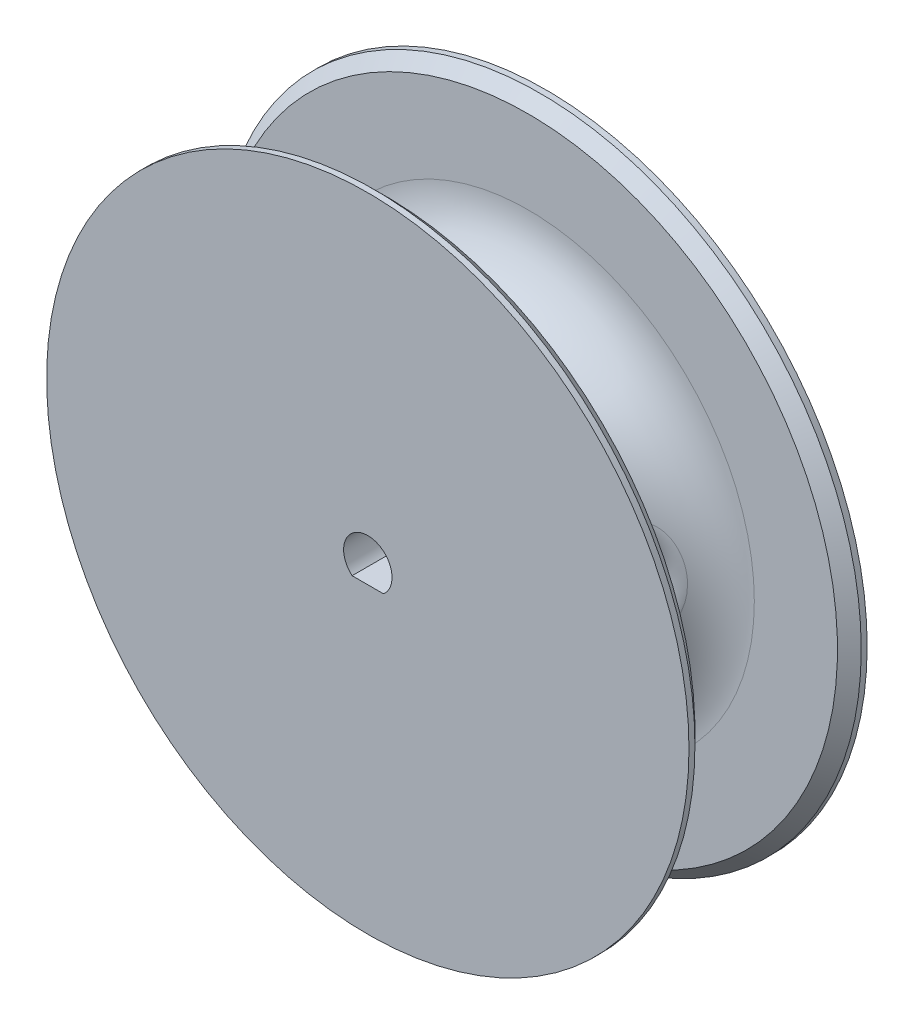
ISO-10303-21;
HEADER;
FILE_DESCRIPTION(('STEP AP214'),'2;1');
FILE_NAME('part.step','',(''),(''),'','','');
FILE_SCHEMA(('AUTOMOTIVE_DESIGN { 1 0 10303 214 1 1 1 1 }'));
ENDSEC;
DATA;
#1=APPLICATION_CONTEXT('core data for automotive mechanical design processes');
#2=APPLICATION_PROTOCOL_DEFINITION('international standard','automotive_design',2000,#1);
#3=PRODUCT_CONTEXT('',#1,'mechanical');
#4=PRODUCT('Part','Part','',(#3));
#5=PRODUCT_RELATED_PRODUCT_CATEGORY('part','',(#4));
#6=PRODUCT_DEFINITION_FORMATION('','',#4);
#7=PRODUCT_DEFINITION_CONTEXT('part definition',#1,'design');
#8=PRODUCT_DEFINITION('design','',#6,#7);
#9=PRODUCT_DEFINITION_SHAPE('','',#8);
#10=(LENGTH_UNIT() NAMED_UNIT(*) SI_UNIT(.MILLI.,.METRE.));
#11=(NAMED_UNIT(*) PLANE_ANGLE_UNIT() SI_UNIT($,.RADIAN.));
#12=(NAMED_UNIT(*) SI_UNIT($,.STERADIAN.) SOLID_ANGLE_UNIT());
#13=UNCERTAINTY_MEASURE_WITH_UNIT(LENGTH_MEASURE(1.E-05),#10,'distance_accuracy_value','');
#14=(GEOMETRIC_REPRESENTATION_CONTEXT(3) GLOBAL_UNCERTAINTY_ASSIGNED_CONTEXT((#13)) GLOBAL_UNIT_ASSIGNED_CONTEXT((#10,
#11,#12)) REPRESENTATION_CONTEXT('',''));
#15=CARTESIAN_POINT('',(0.,0.,0.));
#16=DIRECTION('',(0.,0.,1.));
#17=DIRECTION('',(1.,0.,0.));
#18=AXIS2_PLACEMENT_3D('',#15,#16,#17);
#19=CARTESIAN_POINT('',(0.,0.,0.));
#20=DIRECTION('',(0.,0.,1.));
#21=DIRECTION('',(1.,0.,0.));
#22=AXIS2_PLACEMENT_3D('',#19,#20,#21);
#23=TOROIDAL_SURFACE('',#22,38.075,12.);
#24=CARTESIAN_POINT('',(23.0017040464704,-0.00790425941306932,-9.99525149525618));
#25=CARTESIAN_POINT('',(25.7655326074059,-0.0072062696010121,-5.00340769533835));
#26=CARTESIAN_POINT('',(29.9757593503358,-0.0219885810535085,-8.85451475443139));
#27=CARTESIAN_POINT('',(23.0013549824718,-0.176242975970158,-9.99496477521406));
#28=CARTESIAN_POINT('',(25.7654556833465,-0.160657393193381,-5.00286838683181));
#29=CARTESIAN_POINT('',(29.9749513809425,-0.490285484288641,-8.85409113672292));
#30=CARTESIAN_POINT('',(22.9897942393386,-0.344548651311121,-9.9856063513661));
#31=CARTESIAN_POINT('',(25.7626543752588,-0.314377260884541,-4.98490117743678));
#32=CARTESIAN_POINT('',(29.9482806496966,-0.958508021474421,-8.84017382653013));
#33=CARTESIAN_POINT('',(22.9453725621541,-0.67631852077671,-9.94759251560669));
#34=CARTESIAN_POINT('',(25.7554623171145,-0.607942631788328,-4.91672528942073));
#35=CARTESIAN_POINT('',(29.844498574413,-1.88370264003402,-8.78496240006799));
#36=CARTESIAN_POINT('',(22.9125108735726,-0.839782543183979,-9.91893642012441));
#37=CARTESIAN_POINT('',(25.7510473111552,-0.748392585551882,-4.86620258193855));
#38=CARTESIAN_POINT('',(29.7673854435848,-2.34067432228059,-8.74366731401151));
#39=CARTESIAN_POINT('',(22.8285986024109,-1.15724941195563,-9.83934514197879));
#40=CARTESIAN_POINT('',(25.7507473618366,-1.00598339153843,-4.73993568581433));
#41=CARTESIAN_POINT('',(29.5665154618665,-3.23246750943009,-8.63258397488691));
#42=CARTESIAN_POINT('',(22.7775431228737,-1.31124969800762,-9.78840396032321));
#43=CARTESIAN_POINT('',(25.7549411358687,-1.12336060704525,-4.66373518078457));
#44=CARTESIAN_POINT('',(29.4427460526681,-3.66728301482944,-8.5627880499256));
#45=CARTESIAN_POINT('',(22.6619622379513,-1.605288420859,-9.66042341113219));
#46=CARTESIAN_POINT('',(25.7852175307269,-1.33127126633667,-4.49779562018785));
#47=CARTESIAN_POINT('',(29.1550026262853,-4.50372798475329,-8.39302332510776));
#48=CARTESIAN_POINT('',(22.5974370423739,-1.7453270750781,-9.58338445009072));
#49=CARTESIAN_POINT('',(25.8115892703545,-1.42168143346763,-4.40773878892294));
#50=CARTESIAN_POINT('',(28.9910292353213,-4.90535796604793,-8.29305499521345));
#51=CARTESIAN_POINT('',(22.4616069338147,-2.00598982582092,-9.40054627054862));
#52=CARTESIAN_POINT('',(25.8975659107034,-1.5792751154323,-4.23136621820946));
#53=CARTESIAN_POINT('',(28.6339322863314,-5.66086486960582,-8.06220312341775));
#54=CARTESIAN_POINT('',(22.3903772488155,-2.12679607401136,-9.29504602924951));
#55=CARTESIAN_POINT('',(25.9572542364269,-1.64639277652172,-4.14506632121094));
#56=CARTESIAN_POINT('',(28.4411205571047,-6.01518396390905,-7.93164271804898));
#57=CARTESIAN_POINT('',(22.2474812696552,-2.34716954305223,-9.05256127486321));
#58=CARTESIAN_POINT('',(26.1131697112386,-1.77136682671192,-3.99416256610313));
#59=CARTESIAN_POINT('',(28.036945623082,-6.67079712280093,-7.63756216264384));
#60=CARTESIAN_POINT('',(22.175815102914,-2.44674268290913,-8.91558555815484));
#61=CARTESIAN_POINT('',(26.209600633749,-1.8289499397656,-3.93000775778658));
#62=CARTESIAN_POINT('',(27.825587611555,-6.97210596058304,-7.47405122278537));
#63=CARTESIAN_POINT('',(22.0421297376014,-2.61886328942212,-8.61512923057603));
#64=CARTESIAN_POINT('',(26.4236332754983,-1.95153330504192,-3.84139235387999));
#65=CARTESIAN_POINT('',(27.4062758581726,-7.50326397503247,-7.12020999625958));
#66=CARTESIAN_POINT('',(21.9798570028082,-2.69225076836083,-8.45277324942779));
#67=CARTESIAN_POINT('',(26.540014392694,-2.01596701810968,-3.81607291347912));
#68=CARTESIAN_POINT('',(27.1984711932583,-7.73528551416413,-6.93104961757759));
#69=CARTESIAN_POINT('',(21.869006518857,-2.81549583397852,-8.10016216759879));
#70=CARTESIAN_POINT('',(26.7702836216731,-2.16984686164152,-3.80471249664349));
#71=CARTESIAN_POINT('',(26.7930969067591,-8.1359452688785,-6.52343443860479));
#72=CARTESIAN_POINT('',(21.8204229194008,-2.86536347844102,-7.90991903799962));
#73=CARTESIAN_POINT('',(26.8833169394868,-2.25874002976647,-3.81874049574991));
#74=CARTESIAN_POINT('',(26.5955229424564,-8.30461057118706,-6.30499221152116));
#75=CARTESIAN_POINT('',(21.7448582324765,-2.93984798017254,-7.51537932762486));
#76=CARTESIAN_POINT('',(27.0691763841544,-2.46187819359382,-3.87033128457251));
#77=CARTESIAN_POINT('',(26.2328695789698,-8.56939962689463,-5.85372400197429));
#78=CARTESIAN_POINT('',(21.7169664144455,-2.96554476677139,-7.3121686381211));
#79=CARTESIAN_POINT('',(27.1430797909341,-2.57368282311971,-3.90638175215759));
#80=CARTESIAN_POINT('',(26.0666971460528,-8.66856934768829,-5.62206220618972));
#81=CARTESIAN_POINT('',(21.6827759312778,-2.99685318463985,-6.88978656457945));
#82=CARTESIAN_POINT('',(27.2371973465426,-2.81507242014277,-3.97474267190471));
#83=CARTESIAN_POINT('',(25.7651484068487,-8.80752960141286,-5.14103512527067));
#84=CARTESIAN_POINT('',(21.6764778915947,-3.00246423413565,-6.67061471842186));
#85=CARTESIAN_POINT('',(27.2578059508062,-2.94338186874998,-4.0068209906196));
#86=CARTESIAN_POINT('',(25.6297729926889,-8.84731841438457,-4.89166932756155));
#87=CARTESIAN_POINT('',(21.6870596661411,-2.99555926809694,-6.22122572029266));
#88=CARTESIAN_POINT('',(27.2423248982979,-3.19862466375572,-4.03903441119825));
#89=CARTESIAN_POINT('',(25.3946526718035,-8.87084974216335,-4.37989880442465));
#90=CARTESIAN_POINT('',(21.7040890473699,-2.98292624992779,-5.99094651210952));
#91=CARTESIAN_POINT('',(27.2071953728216,-3.32464194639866,-4.03956000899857));
#92=CARTESIAN_POINT('',(25.295142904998,-8.85422957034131,-4.1174204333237));
#93=CARTESIAN_POINT('',(21.7610637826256,-2.94162836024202,-5.52693027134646));
#94=CARTESIAN_POINT('',(27.09437505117,-3.55293754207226,-3.98944174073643));
#95=CARTESIAN_POINT('',(25.134516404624,-8.76909363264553,-3.58727116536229));
#96=CARTESIAN_POINT('',(21.8010170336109,-2.91295796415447,-5.29319207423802));
#97=CARTESIAN_POINT('',(27.0181838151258,-3.65519850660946,-3.94035001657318));
#98=CARTESIAN_POINT('',(25.0734129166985,-8.70055998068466,-3.31959850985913));
#99=CARTESIAN_POINT('',(21.9073363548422,-2.83771489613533,-4.80194992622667));
#100=CARTESIAN_POINT('',(26.8367076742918,-3.82951559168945,-3.77853630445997));
#101=CARTESIAN_POINT('',(24.9831242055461,-8.50660634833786,-2.75510947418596));
#102=CARTESIAN_POINT('',(21.9761402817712,-2.78950943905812,-4.54468513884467));
#103=CARTESIAN_POINT('',(26.7300195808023,-3.89847775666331,-3.66168433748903));
#104=CARTESIAN_POINT('',(24.9582303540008,-8.37572043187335,-2.45835320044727));
#105=CARTESIAN_POINT('',(22.1352369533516,-2.67792886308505,-4.03852238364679));
#106=CARTESIAN_POINT('',(26.5201924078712,-3.97856439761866,-3.36955836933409));
#107=CARTESIAN_POINT('',(24.9481682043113,-8.06225858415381,-1.87171630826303));
#108=CARTESIAN_POINT('',(22.2255451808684,-2.61454281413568,-3.7896305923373));
#109=CARTESIAN_POINT('',(26.4171730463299,-3.99164786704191,-3.19669991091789));
#110=CARTESIAN_POINT('',(24.9630286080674,-7.87964539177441,-1.58184081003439));
#111=CARTESIAN_POINT('',(22.3829954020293,-2.50192058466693,-3.40222949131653));
#112=CARTESIAN_POINT('',(26.2685499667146,-3.96541829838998,-2.8862445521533));
#113=CARTESIAN_POINT('',(25.0127209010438,-7.54952254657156,-1.12822296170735));
#114=CARTESIAN_POINT('',(22.4449401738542,-2.45717694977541,-3.25941591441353));
#115=CARTESIAN_POINT('',(26.2169158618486,-3.94570995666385,-2.76403926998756));
#116=CARTESIAN_POINT('',(25.0371771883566,-7.41722214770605,-0.960438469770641));
#117=CARTESIAN_POINT('',(22.5734938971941,-2.36266074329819,-2.97940319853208));
#118=CARTESIAN_POINT('',(26.1231791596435,-3.88601748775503,-2.50978698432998));
#119=CARTESIAN_POINT('',(25.0960200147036,-7.13587568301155,-0.630347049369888));
#120=CARTESIAN_POINT('',(22.6401021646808,-2.31288890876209,-2.84220324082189));
#121=CARTESIAN_POINT('',(26.0808677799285,-3.84645616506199,-2.37792666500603));
#122=CARTESIAN_POINT('',(25.130405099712,-6.98683207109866,-0.468039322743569));
#123=CARTESIAN_POINT('',(22.7767602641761,-2.2082027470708,-2.57415946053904));
#124=CARTESIAN_POINT('',(26.0066965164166,-3.74759372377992,-2.10825822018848));
#125=CARTESIAN_POINT('',(25.2073444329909,-6.67198226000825,-0.149829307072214));
#126=CARTESIAN_POINT('',(22.8468132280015,-2.15328369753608,-2.44332164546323));
#127=CARTESIAN_POINT('',(25.9746178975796,-3.68864509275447,-1.97049542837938));
#128=CARTESIAN_POINT('',(25.2499062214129,-6.50616065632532,0.00606690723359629));
#129=CARTESIAN_POINT('',(22.9888772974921,-2.03816190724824,-2.1890537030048));
#130=CARTESIAN_POINT('',(25.921009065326,-3.5515878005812,-1.69307613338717));
#131=CARTESIAN_POINT('',(25.3412644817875,-6.15769283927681,0.310112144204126));
#132=CARTESIAN_POINT('',(23.0608880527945,-1.97796010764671,-2.065622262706));
#133=CARTESIAN_POINT('',(25.8992585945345,-3.47379422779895,-1.55335511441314));
#134=CARTESIAN_POINT('',(25.390059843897,-5.97504962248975,0.458262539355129));
#135=CARTESIAN_POINT('',(23.1941897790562,-1.86164187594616,-1.84548109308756));
#136=CARTESIAN_POINT('',(25.8681819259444,-3.31260008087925,-1.29678619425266));
#137=CARTESIAN_POINT('',(25.4840270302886,-5.62178486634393,0.723426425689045));
#138=CARTESIAN_POINT('',(23.2554295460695,-1.80631677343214,-1.74757785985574));
#139=CARTESIAN_POINT('',(25.8573709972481,-3.23224181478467,-1.17990395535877));
#140=CARTESIAN_POINT('',(25.5286053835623,-5.4536213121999,0.84172873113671));
#141=CARTESIAN_POINT('',(23.3770203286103,-1.69145552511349,-1.5585673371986));
#142=CARTESIAN_POINT('',(25.842045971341,-3.0583109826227,-0.949888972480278));
#143=CARTESIAN_POINT('',(25.6193734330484,-5.10446556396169,1.07079170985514));
#144=CARTESIAN_POINT('',(23.4373710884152,-1.63191819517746,-1.46746197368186));
#145=CARTESIAN_POINT('',(25.8374400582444,-2.96484155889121,-0.836605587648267));
#146=CARTESIAN_POINT('',(25.6655635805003,-4.92346976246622,1.18155024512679));
#147=CARTESIAN_POINT('',(23.6149757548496,-1.44681420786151,-1.20599069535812));
#148=CARTESIAN_POINT('',(25.831786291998,-2.66677469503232,-0.508386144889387));
#149=CARTESIAN_POINT('',(25.8041662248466,-4.36106929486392,1.50033417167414));
#150=CARTESIAN_POINT('',(23.7291435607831,-1.31445527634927,-1.0468860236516));
#151=CARTESIAN_POINT('',(25.8383530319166,-2.44070283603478,-0.299134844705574));
#152=CARTESIAN_POINT('',(25.8968723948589,-3.9593368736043,1.69557216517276));
#153=CARTESIAN_POINT('',(23.9027617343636,-1.07539338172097,-0.813200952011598));
#154=CARTESIAN_POINT('',(25.858538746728,-2.01587999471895,0.0139320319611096));
#155=CARTESIAN_POINT('',(26.0409364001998,-3.23567024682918,1.98361180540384));
#156=CARTESIAN_POINT('',(23.968131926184,-0.973701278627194,-0.72777151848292));
#157=CARTESIAN_POINT('',(25.8691909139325,-1.83161922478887,0.130342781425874));
#158=CARTESIAN_POINT('',(26.0961322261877,-2.92833895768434,2.08932287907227));
#159=CARTESIAN_POINT('',(24.0826675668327,-0.761817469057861,-0.58067624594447));
#160=CARTESIAN_POINT('',(25.8909566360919,-1.44189445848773,0.332079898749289));
#161=CARTESIAN_POINT('',(26.1937689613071,-2.28916736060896,2.27177538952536));
#162=CARTESIAN_POINT('',(24.1318600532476,-0.651640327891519,-0.518970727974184));
#163=CARTESIAN_POINT('',(25.9020997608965,-1.23605535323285,0.418102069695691));
#164=CARTESIAN_POINT('',(26.2362311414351,-1.95736909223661,2.34856519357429));
#165=CARTESIAN_POINT('',(24.2025674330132,-0.44158788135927,-0.431117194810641));
#166=CARTESIAN_POINT('',(25.9190966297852,-0.840500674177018,0.540795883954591));
#167=CARTESIAN_POINT('',(26.2975552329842,-1.3256789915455,2.4580445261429));
#168=CARTESIAN_POINT('',(24.2271080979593,-0.34261318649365,-0.401049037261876));
#169=CARTESIAN_POINT('',(25.925525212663,-0.652600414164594,0.583203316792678));
#170=CARTESIAN_POINT('',(26.3189857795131,-1.02836826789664,2.49559029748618));
#171=CARTESIAN_POINT('',(24.2575256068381,-0.142239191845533,-0.363854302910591));
#172=CARTESIAN_POINT('',(25.9335579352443,-0.271532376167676,0.635550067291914));
#173=CARTESIAN_POINT('',(26.3455736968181,-0.426809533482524,2.54204846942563));
#174=CARTESIAN_POINT('',(24.2634071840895,-0.0408405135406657,-0.356721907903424));
#175=CARTESIAN_POINT('',(25.9351885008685,-0.0777740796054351,0.645664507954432));
#176=CARTESIAN_POINT('',(26.3507351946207,-0.122563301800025,2.55096813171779));
#177=CARTESIAN_POINT('',(24.2557780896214,0.161402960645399,-0.366015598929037));
#178=CARTESIAN_POINT('',(25.9331310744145,0.307748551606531,0.632559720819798));
#179=CARTESIAN_POINT('',(26.3440545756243,0.484354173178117,2.53935336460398));
#180=CARTESIAN_POINT('',(24.2422515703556,0.26224723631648,-0.382460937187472));
#181=CARTESIAN_POINT('',(25.9294319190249,0.500141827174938,0.60927018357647));
#182=CARTESIAN_POINT('',(26.3321985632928,0.787023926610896,2.51879486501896));
#183=CARTESIAN_POINT('',(24.1974166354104,0.460405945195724,-0.437556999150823));
#184=CARTESIAN_POINT('',(25.9179215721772,0.875811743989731,0.531924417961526));
#185=CARTESIAN_POINT('',(26.2931015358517,1.38225381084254,2.45002676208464));
#186=CARTESIAN_POINT('',(24.166120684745,0.557722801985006,-0.476192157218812));
#187=CARTESIAN_POINT('',(25.9100795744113,1.05964298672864,0.477651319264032));
#188=CARTESIAN_POINT('',(26.2658713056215,1.67482087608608,2.40183654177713));
#189=CARTESIAN_POINT('',(24.1092080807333,0.697404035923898,-0.547584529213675));
#190=CARTESIAN_POINT('',(25.8972420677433,1.32042988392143,0.378671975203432));
#191=CARTESIAN_POINT('',(26.2167502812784,2.09527983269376,2.31299158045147));
#192=CARTESIAN_POINT('',(24.0891671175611,0.741914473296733,-0.572866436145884));
#193=CARTESIAN_POINT('',(25.8928833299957,1.40332935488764,0.343640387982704));
#194=CARTESIAN_POINT('',(26.1995029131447,2.22934639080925,2.28155440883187));
#195=CARTESIAN_POINT('',(24.0291616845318,0.864303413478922,-0.649174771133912));
#196=CARTESIAN_POINT('',(25.880556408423,1.63036914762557,0.238263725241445));
#197=CARTESIAN_POINT('',(26.1480793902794,2.59823205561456,2.18677456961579));
#198=CARTESIAN_POINT('',(23.9859761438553,0.940729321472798,-0.7047477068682));
#199=CARTESIAN_POINT('',(25.8724804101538,1.7706196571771,0.161996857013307));
#200=CARTESIAN_POINT('',(26.1113031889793,2.82887134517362,2.11786304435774));
#201=CARTESIAN_POINT('',(23.8924838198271,1.08896157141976,-0.827302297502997));
#202=CARTESIAN_POINT('',(25.8577006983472,2.03901337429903,-0.00418196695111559));
#203=CARTESIAN_POINT('',(26.032508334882,3.27676949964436,1.96627349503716));
#204=CARTESIAN_POINT('',(23.8421675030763,1.16076153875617,-0.894299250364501));
#205=CARTESIAN_POINT('',(25.850999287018,2.16724489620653,-0.0943633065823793));
#206=CARTESIAN_POINT('',(25.9904826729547,3.49400988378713,1.88357701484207));
#207=CARTESIAN_POINT('',(23.7361676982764,1.30007348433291,-1.03850597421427));
#208=CARTESIAN_POINT('',(25.8405186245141,2.4117403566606,-0.285755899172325));
#209=CARTESIAN_POINT('',(25.9031095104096,3.91599233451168,1.70607195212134));
#210=CARTESIAN_POINT('',(23.6804529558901,1.36755621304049,-1.11577631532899));
#211=CARTESIAN_POINT('',(25.8367820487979,2.52795237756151,-0.387268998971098));
#212=CARTESIAN_POINT('',(25.857743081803,4.12064884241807,1.61119165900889));
#213=CARTESIAN_POINT('',(23.565727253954,1.49786593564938,-1.2788297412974));
#214=CARTESIAN_POINT('',(25.8336736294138,2.74728766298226,-0.597961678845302));
#215=CARTESIAN_POINT('',(25.7658745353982,4.51617277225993,1.41157448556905));
#216=CARTESIAN_POINT('',(23.5067171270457,1.56069409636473,-1.3646106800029));
#217=CARTESIAN_POINT('',(25.8343510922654,2.85038753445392,-0.707355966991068));
#218=CARTESIAN_POINT('',(25.7193727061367,4.70704364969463,1.30684009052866));
#219=CARTESIAN_POINT('',(23.3692344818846,1.6998144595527,-1.57000120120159));
#220=CARTESIAN_POINT('',(25.8422421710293,3.07240847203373,-0.964767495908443));
#221=CARTESIAN_POINT('',(25.6132905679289,5.12984475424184,1.05684639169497));
#222=CARTESIAN_POINT('',(23.2901481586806,1.7746228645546,-1.6921336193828));
#223=CARTESIAN_POINT('',(25.8514512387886,3.18634091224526,-1.11437693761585));
#224=CARTESIAN_POINT('',(25.5538916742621,5.35731311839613,0.908736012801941));
#225=CARTESIAN_POINT('',(23.1316285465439,1.91738486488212,-1.94707335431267));
#226=CARTESIAN_POINT('',(25.8808958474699,3.39230197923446,-1.41708735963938));
#227=CARTESIAN_POINT('',(25.4391812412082,5.79113782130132,0.600854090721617));
#228=CARTESIAN_POINT('',(23.052195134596,1.98533578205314,-2.07988480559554));
#229=CARTESIAN_POINT('',(25.9013687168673,3.4840333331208,-1.57045672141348));
#230=CARTESIAN_POINT('',(25.3838713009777,5.99748591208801,0.441078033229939));
#231=CARTESIAN_POINT('',(22.8952683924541,2.11474529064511,-2.35463855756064));
#232=CARTESIAN_POINT('',(25.9543532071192,3.64523387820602,-1.8757635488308));
#233=CARTESIAN_POINT('',(25.2801790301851,6.38964866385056,0.111910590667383));
#234=CARTESIAN_POINT('',(22.8177739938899,2.17620752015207,-2.49657566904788));
#235=CARTESIAN_POINT('',(25.9871396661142,3.71432741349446,-2.02782772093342));
#236=CARTESIAN_POINT('',(25.2317928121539,6.5754748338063,-0.0574753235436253));
#237=CARTESIAN_POINT('',(22.6666076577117,2.29295203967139,-2.78840588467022));
#238=CARTESIAN_POINT('',(26.0648602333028,3.82978613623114,-2.32576710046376));
#239=CARTESIAN_POINT('',(25.1444701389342,6.9270472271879,-0.404331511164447));
#240=CARTESIAN_POINT('',(22.5929352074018,2.34823515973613,-2.93829791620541));
#241=CARTESIAN_POINT('',(26.1100940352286,3.87567574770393,-2.47159979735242));
#242=CARTESIAN_POINT('',(25.1055324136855,7.09279614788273,-0.581800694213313));
#243=CARTESIAN_POINT('',(22.4497426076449,2.45375822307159,-3.24789772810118));
#244=CARTESIAN_POINT('',(26.212682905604,3.94476818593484,-2.75491252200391));
#245=CARTESIAN_POINT('',(25.038852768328,7.40716396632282,-0.946936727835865));
#246=CARTESIAN_POINT('',(22.3803305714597,2.50387969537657,-3.40773942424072));
#247=CARTESIAN_POINT('',(26.2705253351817,3.96691846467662,-2.8918663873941));
#248=CARTESIAN_POINT('',(25.0113423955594,7.55538872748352,-1.13473454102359));
#249=CARTESIAN_POINT('',(22.2489199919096,2.59776115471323,-3.73332233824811));
#250=CARTESIAN_POINT('',(26.3951033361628,3.98639564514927,-3.14884408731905));
#251=CARTESIAN_POINT('',(24.9710245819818,7.83031237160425,-1.51583927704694));
#252=CARTESIAN_POINT('',(22.1869223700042,2.64152035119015,-3.89906428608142));
#253=CARTESIAN_POINT('',(26.4620504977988,3.98308581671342,-3.26840305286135));
#254=CARTESIAN_POINT('',(24.9582189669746,7.95700857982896,-1.70914688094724));
#255=CARTESIAN_POINT('',(22.0720131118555,2.72231812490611,-4.23475250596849));
#256=CARTESIAN_POINT('',(26.6001421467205,3.95169929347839,-3.48522010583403));
#257=CARTESIAN_POINT('',(24.9495596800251,8.18754798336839,-2.09933513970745));
#258=CARTESIAN_POINT('',(22.0190856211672,2.75936843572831,-4.40469083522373));
#259=CARTESIAN_POINT('',(26.6713348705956,3.92304079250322,-3.58186135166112));
#260=CARTESIAN_POINT('',(24.9536761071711,8.29143114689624,-2.29620888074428));
#261=CARTESIAN_POINT('',(21.9236176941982,2.82634827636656,-4.74741264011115));
#262=CARTESIAN_POINT('',(26.8114146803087,3.8422280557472,-3.74883476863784));
#263=CARTESIAN_POINT('',(24.9807555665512,8.47505324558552,-2.69206303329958));
#264=CARTESIAN_POINT('',(21.8810730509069,2.8562806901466,-4.9201949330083));
#265=CARTESIAN_POINT('',(26.8801365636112,3.78954508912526,-3.8183777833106));
#266=CARTESIAN_POINT('',(25.0037109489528,8.55480196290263,-2.8910425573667));
#267=CARTESIAN_POINT('',(21.8174880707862,2.90132094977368,-5.21991977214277));
#268=CARTESIAN_POINT('',(26.9895143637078,3.68111288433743,-3.91373601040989));
#269=CARTESIAN_POINT('',(25.0609912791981,8.6702542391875,-3.23534865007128));
#270=CARTESIAN_POINT('',(21.7937429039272,2.91824951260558,-5.34664878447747));
#271=CARTESIAN_POINT('',(27.0328088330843,3.62961053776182,-3.94613032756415));
#272=CARTESIAN_POINT('',(25.0905757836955,8.7120361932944,-3.38066221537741));
#273=CARTESIAN_POINT('',(21.7527885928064,2.94763119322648,-5.59975920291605));
#274=CARTESIAN_POINT('',(27.1101998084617,3.51767827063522,-3.99583194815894));
#275=CARTESIAN_POINT('',(25.1609150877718,8.78090999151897,-3.67045131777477));
#276=CARTESIAN_POINT('',(21.7355779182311,2.96008535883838,-5.72614068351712));
#277=CARTESIAN_POINT('',(27.1440837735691,3.45718799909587,-4.01285089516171));
#278=CARTESIAN_POINT('',(25.2016672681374,8.80800527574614,-3.8149270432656));
#279=CARTESIAN_POINT('',(21.7079504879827,2.98016457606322,-5.97758254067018));
#280=CARTESIAN_POINT('',(27.1993456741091,3.32993296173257,-4.03308770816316));
#281=CARTESIAN_POINT('',(25.2944303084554,8.84666872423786,-4.10203462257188));
#282=CARTESIAN_POINT('',(21.6975305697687,2.98779187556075,-6.10264350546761));
#283=CARTESIAN_POINT('',(27.2204851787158,3.26319345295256,-4.03608054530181));
#284=CARTESIAN_POINT('',(25.3464359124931,8.85824411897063,-4.24466730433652));
#285=CARTESIAN_POINT('',(21.6835800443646,2.99786034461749,-6.3505100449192));
#286=CARTESIAN_POINT('',(27.2476874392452,3.12656089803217,-4.03080535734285));
#287=CARTESIAN_POINT('',(25.4615199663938,8.86509449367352,-4.52714823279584));
#288=CARTESIAN_POINT('',(21.6800496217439,3.00030137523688,-6.47331555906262));
#289=CARTESIAN_POINT('',(27.2535141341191,3.05677265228,-4.02238874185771));
#290=CARTESIAN_POINT('',(25.5245987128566,8.86036903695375,-4.66699640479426));
#291=CARTESIAN_POINT('',(21.6798166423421,2.99963750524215,-6.71627687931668));
#292=CARTESIAN_POINT('',(27.2486902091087,2.91703568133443,-3.99785511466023));
#293=CARTESIAN_POINT('',(25.6616510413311,8.8338494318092,-4.94359862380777));
#294=CARTESIAN_POINT('',(21.68315059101,2.99650296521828,-6.83641506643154));
#295=CARTESIAN_POINT('',(27.2377638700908,2.84726357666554,-3.98163784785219));
#296=CARTESIAN_POINT('',(25.7356809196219,8.81196441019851,-5.08033219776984));
#297=CARTESIAN_POINT('',(21.6964652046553,2.98430337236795,-7.07231347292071));
#298=CARTESIAN_POINT('',(27.1994925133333,2.71115018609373,-3.94593940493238));
#299=CARTESIAN_POINT('',(25.8934647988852,8.75047522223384,-5.34889052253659));
#300=CARTESIAN_POINT('',(21.7064459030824,2.97523828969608,-7.18807367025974));
#301=CARTESIAN_POINT('',(27.1720430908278,2.64501466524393,-3.92647332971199));
#302=CARTESIAN_POINT('',(25.9772188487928,8.71087096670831,-5.48071524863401));
#303=CARTESIAN_POINT('',(21.732600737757,2.95091558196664,-7.41420885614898));
#304=CARTESIAN_POINT('',(27.1027045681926,2.51871603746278,-3.88891782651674));
#305=CARTESIAN_POINT('',(26.1531619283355,8.61363697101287,-5.73846805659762));
#306=CARTESIAN_POINT('',(21.7487739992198,2.93565883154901,-7.52458460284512));
#307=CARTESIAN_POINT('',(27.0608083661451,2.45875602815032,-3.87088611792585));
#308=CARTESIAN_POINT('',(26.2453497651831,8.55600977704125,-5.86439696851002));
#309=CARTESIAN_POINT('',(21.7866800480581,2.89877408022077,-7.73908163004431));
#310=CARTESIAN_POINT('',(26.966062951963,2.3462703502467,-3.84036084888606));
#311=CARTESIAN_POINT('',(26.4365831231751,8.42267667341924,-6.10952410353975));
#312=CARTESIAN_POINT('',(21.8084124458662,2.87714652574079,-7.84320334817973));
#313=CARTESIAN_POINT('',(26.9132858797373,2.29391723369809,-3.82792908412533));
#314=CARTESIAN_POINT('',(26.5356281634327,8.3469720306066,-6.2287227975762));
#315=CARTESIAN_POINT('',(21.854554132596,2.82959991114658,-8.03573047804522));
#316=CARTESIAN_POINT('',(26.8060998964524,2.20108058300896,-3.81241176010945));
#317=CARTESIAN_POINT('',(26.7299404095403,8.1850564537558,-6.44967959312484));
#318=CARTESIAN_POINT('',(21.878567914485,2.80421557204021,-8.12471580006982));
#319=CARTESIAN_POINT('',(26.7523149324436,2.1600564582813,-3.80863668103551));
#320=CARTESIAN_POINT('',(26.8247905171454,8.10032570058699,-6.55205376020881));
#321=CARTESIAN_POINT('',(21.9298982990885,2.74807667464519,-8.29646676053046));
#322=CARTESIAN_POINT('',(26.6428920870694,2.08368923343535,-3.8096534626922));
#323=CARTESIAN_POINT('',(27.0172319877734,7.91630803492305,-6.75025740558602));
#324=CARTESIAN_POINT('',(21.9572160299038,2.71732028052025,-8.37923025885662));
#325=CARTESIAN_POINT('',(26.5873490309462,2.04841405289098,-3.81444657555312));
#326=CARTESIAN_POINT('',(27.1148242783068,7.81701614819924,-6.84608463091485));
#327=CARTESIAN_POINT('',(22.0144017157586,2.65054111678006,-8.53816959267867));
#328=CARTESIAN_POINT('',(26.4777867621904,1.98224042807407,-3.83298733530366));
#329=CARTESIAN_POINT('',(27.3111426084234,7.60445787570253,-7.0308458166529));
#330=CARTESIAN_POINT('',(22.0442685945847,2.61452056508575,-8.6143481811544));
#331=CARTESIAN_POINT('',(26.4238466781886,1.9513824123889,-3.84670196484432));
#332=CARTESIAN_POINT('',(27.4098681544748,7.49119737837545,-7.11978265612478));
#333=CARTESIAN_POINT('',(22.1058048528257,2.53736235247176,-8.75999968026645));
#334=CARTESIAN_POINT('',(26.320159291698,1.89229617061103,-3.88254975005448));
#335=CARTESIAN_POINT('',(27.6069782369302,7.2513425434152,-7.29066864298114));
#336=CARTESIAN_POINT('',(22.1374749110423,2.49622275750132,-8.82947003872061));
#337=CARTESIAN_POINT('',(26.2704648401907,1.86409741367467,-3.90463805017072));
#338=CARTESIAN_POINT('',(27.7053626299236,7.12474316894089,-7.37261512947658));
#339=CARTESIAN_POINT('',(22.2340548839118,2.36539738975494,-9.02771251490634));
#340=CARTESIAN_POINT('',(26.1311248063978,1.78071637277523,-3.98173912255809));
#341=CARTESIAN_POINT('',(27.9977906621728,6.72598743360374,-7.6078782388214));
#342=CARTESIAN_POINT('',(22.300561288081,2.26827512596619,-9.14638666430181));
#343=CARTESIAN_POINT('',(26.0506948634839,1.72651970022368,-4.0475771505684));
#344=CARTESIAN_POINT('',(28.1891988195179,6.43477802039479,-7.75070056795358));
#345=CARTESIAN_POINT('',(22.431820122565,2.0566514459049,-9.35726663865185));
#346=CARTESIAN_POINT('',(25.9215557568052,1.60694652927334,-4.19469827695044));
#347=CARTESIAN_POINT('',(28.5537685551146,5.80928442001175,-8.00849494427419));
#348=CARTESIAN_POINT('',(22.496572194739,1.94214651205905,-9.44946709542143));
#349=CARTESIAN_POINT('',(25.872620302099,1.54179493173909,-4.27568655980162));
#350=CARTESIAN_POINT('',(28.7269264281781,5.47499151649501,-8.12346134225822));
#351=CARTESIAN_POINT('',(22.6220170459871,1.69275331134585,-9.61335603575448));
#352=CARTESIAN_POINT('',(25.8006015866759,1.38793828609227,-4.44167898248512));
#353=CARTESIAN_POINT('',(29.0538534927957,4.75436085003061,-8.33175006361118));
#354=CARTESIAN_POINT('',(22.6823729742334,1.55715711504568,-9.68386808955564));
#355=CARTESIAN_POINT('',(25.7784703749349,1.29847409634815,-4.52674362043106));
#356=CARTESIAN_POINT('',(29.2063182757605,4.36630932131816,-8.42379148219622));
#357=CARTESIAN_POINT('',(22.790325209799,1.27358277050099,-9.80140044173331));
#358=CARTESIAN_POINT('',(25.7534777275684,1.09493175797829,-4.6827120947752));
#359=CARTESIAN_POINT('',(29.4738793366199,3.5608150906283,-8.58048244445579));
#360=CARTESIAN_POINT('',(22.8379188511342,1.12560204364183,-9.84841583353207));
#361=CARTESIAN_POINT('',(25.7503863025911,0.980929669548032,-4.75391217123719));
#362=CARTESIAN_POINT('',(29.58896780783,3.1433662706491,-8.64512626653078));
#363=CARTESIAN_POINT('',(22.9176649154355,0.81588680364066,-9.92354087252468));
#364=CARTESIAN_POINT('',(25.7515515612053,0.728152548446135,-4.87407825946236));
#365=CARTESIAN_POINT('',(29.7795484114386,2.27379418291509,-8.75023946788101));
#366=CARTESIAN_POINT('',(22.9492265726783,0.653853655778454,-9.9509406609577));
#367=CARTESIAN_POINT('',(25.7560022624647,0.588367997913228,-4.92263387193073));
#368=CARTESIAN_POINT('',(29.8535339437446,1.82097108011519,-8.78979575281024));
#369=CARTESIAN_POINT('',(22.9914196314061,0.325235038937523,-9.98693854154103));
#370=CARTESIAN_POINT('',(25.763018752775,0.296893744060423,-4.98742022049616));
#371=CARTESIAN_POINT('',(29.9520410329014,0.904745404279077,-8.84214399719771));
#372=CARTESIAN_POINT('',(23.0020494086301,0.158649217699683,-9.99553517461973));
#373=CARTESIAN_POINT('',(25.7656087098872,0.144605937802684,-5.00394124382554));
#374=CARTESIAN_POINT('',(29.9765587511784,0.441342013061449,-8.85493387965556));
#375=CARTESIAN_POINT('',(23.0017040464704,-0.00790425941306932,-9.99525149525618));
#376=CARTESIAN_POINT('',(25.7655326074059,-0.0072062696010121,-5.00340769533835));
#377=CARTESIAN_POINT('',(29.9757593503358,-0.0219885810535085,-8.85451475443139));
#378=(BOUNDED_SURFACE() B_SPLINE_SURFACE(3,2,((#24,#25,#26),(#27,#28,#29),(#30,#31,#32),(#33,
#34,#35),(#36,#37,#38),(#39,#40,#41),(#42,#43,#44),(#45,#46,#47),(#48,#49,#50),(#51,#52,#53),
(#54,#55,#56),(#57,#58,#59),(#60,#61,#62),(#63,#64,#65),(#66,#67,#68),(#69,#70,#71),(#72,#73,
#74),(#75,#76,#77),(#78,#79,#80),(#81,#82,#83),(#84,#85,#86),(#87,#88,#89),(#90,#91,#92),(#93,
#94,#95),(#96,#97,#98),(#99,#100,#101),(#102,#103,#104),(#105,#106,#107),(#108,#109,#110),(#111,
#112,#113),(#114,#115,#116),(#117,#118,#119),(#120,#121,#122),(#123,#124,#125),(#126,#127,#128),
(#129,#130,#131),(#132,#133,#134),(#135,#136,#137),(#138,#139,#140),(#141,#142,#143),(#144,#145,
#146),(#147,#148,#149),(#150,#151,#152),(#153,#154,#155),(#156,#157,#158),(#159,#160,#161),
(#162,#163,#164),(#165,#166,#167),(#168,#169,#170),(#171,#172,#173),(#174,#175,#176),(#177,#178,
#179),(#180,#181,#182),(#183,#184,#185),(#186,#187,#188),(#189,#190,#191),(#192,#193,#194),
(#195,#196,#197),(#198,#199,#200),(#201,#202,#203),(#204,#205,#206),(#207,#208,#209),(#210,#211,
#212),(#213,#214,#215),(#216,#217,#218),(#219,#220,#221),(#222,#223,#224),(#225,#226,#227),
(#228,#229,#230),(#231,#232,#233),(#234,#235,#236),(#237,#238,#239),(#240,#241,#242),(#243,#244,
#245),(#246,#247,#248),(#249,#250,#251),(#252,#253,#254),(#255,#256,#257),(#258,#259,#260),
(#261,#262,#263),(#264,#265,#266),(#267,#268,#269),(#270,#271,#272),(#273,#274,#275),(#276,#277,
#278),(#279,#280,#281),(#282,#283,#284),(#285,#286,#287),(#288,#289,#290),(#291,#292,#293),
(#294,#295,#296),(#297,#298,#299),(#300,#301,#302),(#303,#304,#305),(#306,#307,#308),(#309,#310,
#311),(#312,#313,#314),(#315,#316,#317),(#318,#319,#320),(#321,#322,#323),(#324,#325,#326),
(#327,#328,#329),(#330,#331,#332),(#333,#334,#335),(#336,#337,#338),(#339,#340,#341),(#342,#343,
#344),(#345,#346,#347),(#348,#349,#350),(#351,#352,#353),(#354,#355,#356),(#357,#358,#359),
(#360,#361,#362),(#363,#364,#365),(#366,#367,#368),(#369,#370,#371),(#372,#373,#374),(#375,#376,
#377)),.UNSPECIFIED.,.T.,.F.,.F.) B_SPLINE_SURFACE_WITH_KNOTS((4,2,2,2,2,2,2,2,2,2,2,2,2,2,2,2,
2,2,2,2,2,2,2,2,2,2,2,2,2,2,2,2,2,2,2,2,2,2,2,2,2,2,2,2,2,2,2,2,2,2,2,2,2,2,2,2,2,2,4),(3,3),
(0.,1.26107549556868,2.52219566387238,3.78365552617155,5.04509574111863,6.29376878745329,
7.54209329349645,8.74572087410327,9.94883327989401,11.0952062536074,12.2416124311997,
13.3954034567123,14.5495921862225,15.8317838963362,17.1149015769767,17.8843959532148,
18.6537776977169,19.4238723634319,20.1938301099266,20.8456023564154,21.4975585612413,
22.7977566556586,23.6893133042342,24.5793722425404,25.3372264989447,26.0948884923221,
26.8531695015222,27.610919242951,27.9727690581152,28.6208166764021,29.2697390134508,
29.9226726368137,30.5754420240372,31.4204479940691,32.2657827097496,33.1106409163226,
33.9553854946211,34.8164977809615,35.6777169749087,36.5374150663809,37.3967642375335,
38.0241899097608,38.651468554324,39.2784548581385,39.9054579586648,40.5358041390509,
41.1661534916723,41.7964138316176,42.426630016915,43.0022005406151,43.5779681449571,
44.1534938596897,44.7292376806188,45.8802143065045,47.0314241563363,48.2370836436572,
49.4429947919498,50.6905997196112,51.938301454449),(0.,1.),
.UNSPECIFIED.) GEOMETRIC_REPRESENTATION_ITEM() RATIONAL_B_SPLINE_SURFACE(((1.,0.61924958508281,
1.),(1.,0.619225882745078,1.),(1.,0.618437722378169,1.),(1.,0.615456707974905,1.),(1.,
0.613263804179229,1.),(1.,0.607813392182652,1.),(1.,0.604555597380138,1.),(1.,0.597479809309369,
1.),(1.,0.593661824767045,1.),(1.,0.586131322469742,1.),(1.,0.58241812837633,1.),(1.,
0.575766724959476,1.),(1.,0.572828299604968,1.),(1.,0.568576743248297,1.),(1.,0.567209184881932,
1.),(1.,0.566577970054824,1.),(1.,0.567313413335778,1.),(1.,0.571269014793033,1.),(1.,
0.57437035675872,1.),(1.,0.583045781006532,1.),(1.,0.588619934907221,1.),(1.,0.602098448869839,
1.),(1.,0.610017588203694,1.),(1.,0.627732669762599,1.),(1.,0.637529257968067,1.),(1.,
0.659598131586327,1.),(1.,0.672024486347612,1.),(1.,0.697736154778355,1.),(1.,0.711022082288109,
1.),(1.,0.732400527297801,1.),(1.,0.740443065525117,1.),(1.,0.756461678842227,1.),(1.,
0.764437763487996,1.),(1.,0.780211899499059,1.),(1.,0.788009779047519,1.),(1.,0.803307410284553,
1.),(1.,0.810807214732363,1.),(1.,0.82427908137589,1.),(1.,0.830308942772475,1.),(1.,
0.842005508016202,1.),(1.,0.84767210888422,1.),(1.,0.86399333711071,1.),(1.,0.874005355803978,
1.),(1.,0.888761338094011,1.),(1.,0.894172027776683,1.),(1.,0.903501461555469,1.),(1.,
0.907422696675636,1.),(1.,0.913008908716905,1.),(1.,0.91492250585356,1.),(1.,0.917289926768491,
1.),(1.,0.917744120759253,1.),(1.,0.917152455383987,1.),(1.,0.916105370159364,1.),(1.,
0.912599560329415,1.),(1.,0.910141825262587,1.),(1.,0.905605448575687,1.),(1.,0.90399963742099,
1.),(1.,0.899155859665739,1.),(1.,0.895631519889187,1.),(1.,0.887872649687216,1.),(1.,
0.883637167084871,1.),(1.,0.874542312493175,1.),(1.,0.869679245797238,1.),(1.,0.859450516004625,
1.),(1.,0.854084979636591,1.),(1.,0.841292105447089,1.),(1.,0.833722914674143,1.),(1.,
0.818042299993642,1.),(1.,0.809930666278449,1.),(1.,0.793319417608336,1.),(1.,0.784820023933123,
1.),(1.,0.767576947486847,1.),(1.,0.75883329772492,1.),(1.,0.741084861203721,1.),(1.,
0.732078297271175,1.),(1.,0.714150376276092,1.),(1.,0.70522902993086,1.),(1.,0.687690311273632,
1.),(1.,0.679072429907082,1.),(1.,0.662348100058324,1.),(1.,0.654241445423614,1.),(1.,
0.640861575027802,1.),(1.,0.63541412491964,1.),(1.,0.625006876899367,1.),(1.,0.620046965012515,
1.),(1.,0.610700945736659,1.),(1.,0.606314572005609,1.),(1.,0.598185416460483,1.),(1.,
0.594442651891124,1.),(1.,0.587637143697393,1.),(1.,0.584578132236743,1.),(1.,0.57919640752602,
1.),(1.,0.576873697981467,1.),(1.,0.57296727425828,1.),(1.,0.571383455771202,1.),(1.,
0.568927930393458,1.),(1.,0.568056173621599,1.),(1.,0.56701861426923,1.),(1.,0.566798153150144,
1.),(1.,0.56685074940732,1.),(1.,0.567123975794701,1.),(1.,0.568097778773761,1.),(1.,
0.56879817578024,1.),(1.,0.570553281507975,1.),(1.,0.571608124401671,1.),(1.,0.575191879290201,
1.),(1.,0.578140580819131,1.),(1.,0.584556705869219,1.),(1.,0.588024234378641,1.),(1.,
0.595101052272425,1.),(1.,0.598709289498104,1.),(1.,0.605365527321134,1.),(1.,0.608413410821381,
1.),(1.,0.613605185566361,1.),(1.,0.615714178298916,1.),(1.,0.618548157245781,1.),(1.,
0.619273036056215,1.),(1.,0.61924958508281,1.))) REPRESENTATION_ITEM('') SURFACE());
#379=CARTESIAN_POINT('',(29.9757593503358,-0.0219885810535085,-8.85451475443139));
#380=CARTESIAN_POINT('',(29.9749513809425,-0.490285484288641,-8.85409113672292));
#381=CARTESIAN_POINT('',(29.9482806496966,-0.958508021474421,-8.84017382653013));
#382=CARTESIAN_POINT('',(29.844498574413,-1.88370264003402,-8.78496240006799));
#383=CARTESIAN_POINT('',(29.7673854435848,-2.34067432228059,-8.74366731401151));
#384=CARTESIAN_POINT('',(29.5665154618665,-3.23246750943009,-8.63258397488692));
#385=CARTESIAN_POINT('',(29.4427460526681,-3.66728301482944,-8.5627880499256));
#386=CARTESIAN_POINT('',(29.1550026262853,-4.50372798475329,-8.39302332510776));
#387=CARTESIAN_POINT('',(28.9910292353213,-4.90535796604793,-8.29305499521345));
#388=CARTESIAN_POINT('',(28.6339322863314,-5.66086486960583,-8.06220312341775));
#389=CARTESIAN_POINT('',(28.4411205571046,-6.01518396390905,-7.93164271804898));
#390=CARTESIAN_POINT('',(28.036945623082,-6.67079712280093,-7.63756216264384));
#391=CARTESIAN_POINT('',(27.825587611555,-6.97210596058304,-7.47405122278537));
#392=CARTESIAN_POINT('',(27.4062758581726,-7.50326397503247,-7.12020999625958));
#393=CARTESIAN_POINT('',(27.1984711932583,-7.73528551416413,-6.93104961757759));
#394=CARTESIAN_POINT('',(26.7930969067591,-8.1359452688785,-6.52343443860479));
#395=CARTESIAN_POINT('',(26.5955229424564,-8.30461057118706,-6.30499221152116));
#396=CARTESIAN_POINT('',(26.2328695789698,-8.56939962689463,-5.85372400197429));
#397=CARTESIAN_POINT('',(26.0666971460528,-8.66856934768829,-5.62206220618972));
#398=CARTESIAN_POINT('',(25.7651484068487,-8.80752960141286,-5.14103512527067));
#399=CARTESIAN_POINT('',(25.6297729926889,-8.84731841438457,-4.89166932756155));
#400=CARTESIAN_POINT('',(25.3946526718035,-8.87084974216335,-4.37989880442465));
#401=CARTESIAN_POINT('',(25.295142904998,-8.85422957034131,-4.1174204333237));
#402=CARTESIAN_POINT('',(25.134516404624,-8.76909363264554,-3.58727116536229));
#403=CARTESIAN_POINT('',(25.0734129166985,-8.70055998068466,-3.31959850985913));
#404=CARTESIAN_POINT('',(24.9831242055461,-8.50660634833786,-2.75510947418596));
#405=CARTESIAN_POINT('',(24.9582303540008,-8.37572043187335,-2.45835320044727));
#406=CARTESIAN_POINT('',(24.9481682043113,-8.06225858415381,-1.87171630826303));
#407=CARTESIAN_POINT('',(24.9630286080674,-7.87964539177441,-1.58184081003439));
#408=CARTESIAN_POINT('',(25.0127209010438,-7.54952254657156,-1.12822296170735));
#409=CARTESIAN_POINT('',(25.0371771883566,-7.41722214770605,-0.960438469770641));
#410=CARTESIAN_POINT('',(25.0960200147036,-7.13587568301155,-0.630347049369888));
#411=CARTESIAN_POINT('',(25.130405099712,-6.98683207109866,-0.468039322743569));
#412=CARTESIAN_POINT('',(25.2073444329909,-6.67198226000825,-0.149829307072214));
#413=CARTESIAN_POINT('',(25.2499062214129,-6.50616065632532,0.00606690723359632));
#414=CARTESIAN_POINT('',(25.3412644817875,-6.15769283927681,0.310112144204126));
#415=CARTESIAN_POINT('',(25.390059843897,-5.97504962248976,0.458262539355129));
#416=CARTESIAN_POINT('',(25.4840270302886,-5.62178486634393,0.723426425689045));
#417=CARTESIAN_POINT('',(25.5286053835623,-5.4536213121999,0.84172873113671));
#418=CARTESIAN_POINT('',(25.6193734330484,-5.10446556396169,1.07079170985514));
#419=CARTESIAN_POINT('',(25.6655635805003,-4.92346976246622,1.18155024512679));
#420=CARTESIAN_POINT('',(25.8041662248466,-4.36106929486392,1.50033417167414));
#421=CARTESIAN_POINT('',(25.8968723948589,-3.95933687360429,1.69557216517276));
#422=CARTESIAN_POINT('',(26.0409364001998,-3.23567024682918,1.98361180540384));
#423=CARTESIAN_POINT('',(26.0961322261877,-2.92833895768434,2.08932287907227));
#424=CARTESIAN_POINT('',(26.1937689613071,-2.28916736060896,2.27177538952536));
#425=CARTESIAN_POINT('',(26.2362311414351,-1.9573690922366,2.34856519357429));
#426=CARTESIAN_POINT('',(26.2975552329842,-1.3256789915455,2.4580445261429));
#427=CARTESIAN_POINT('',(26.3189857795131,-1.02836826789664,2.49559029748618));
#428=CARTESIAN_POINT('',(26.3455736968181,-0.426809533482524,2.54204846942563));
#429=CARTESIAN_POINT('',(26.3507351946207,-0.122563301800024,2.55096813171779));
#430=CARTESIAN_POINT('',(26.3440545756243,0.484354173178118,2.53935336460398));
#431=CARTESIAN_POINT('',(26.3321985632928,0.787023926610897,2.51879486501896));
#432=CARTESIAN_POINT('',(26.2931015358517,1.38225381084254,2.45002676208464));
#433=CARTESIAN_POINT('',(26.2658713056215,1.67482087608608,2.40183654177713));
#434=CARTESIAN_POINT('',(26.2167502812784,2.09527983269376,2.31299158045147));
#435=CARTESIAN_POINT('',(26.1995029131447,2.22934639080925,2.28155440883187));
#436=CARTESIAN_POINT('',(26.1480793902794,2.59823205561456,2.18677456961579));
#437=CARTESIAN_POINT('',(26.1113031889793,2.82887134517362,2.11786304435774));
#438=CARTESIAN_POINT('',(26.0325083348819,3.27676949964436,1.96627349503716));
#439=CARTESIAN_POINT('',(25.9904826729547,3.49400988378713,1.88357701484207));
#440=CARTESIAN_POINT('',(25.9031095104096,3.91599233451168,1.70607195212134));
#441=CARTESIAN_POINT('',(25.857743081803,4.12064884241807,1.61119165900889));
#442=CARTESIAN_POINT('',(25.7658745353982,4.51617277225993,1.41157448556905));
#443=CARTESIAN_POINT('',(25.7193727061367,4.70704364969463,1.30684009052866));
#444=CARTESIAN_POINT('',(25.6132905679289,5.12984475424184,1.05684639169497));
#445=CARTESIAN_POINT('',(25.5538916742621,5.35731311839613,0.908736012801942));
#446=CARTESIAN_POINT('',(25.4391812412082,5.79113782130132,0.600854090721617));
#447=CARTESIAN_POINT('',(25.3838713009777,5.99748591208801,0.441078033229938));
#448=CARTESIAN_POINT('',(25.2801790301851,6.38964866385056,0.111910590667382));
#449=CARTESIAN_POINT('',(25.2317928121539,6.5754748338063,-0.0574753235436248));
#450=CARTESIAN_POINT('',(25.1444701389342,6.9270472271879,-0.404331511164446));
#451=CARTESIAN_POINT('',(25.1055324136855,7.09279614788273,-0.581800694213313));
#452=CARTESIAN_POINT('',(25.038852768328,7.40716396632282,-0.946936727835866));
#453=CARTESIAN_POINT('',(25.0113423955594,7.55538872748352,-1.13473454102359));
#454=CARTESIAN_POINT('',(24.9710245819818,7.83031237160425,-1.51583927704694));
#455=CARTESIAN_POINT('',(24.9582189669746,7.95700857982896,-1.70914688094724));
#456=CARTESIAN_POINT('',(24.9495596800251,8.18754798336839,-2.09933513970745));
#457=CARTESIAN_POINT('',(24.9536761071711,8.29143114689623,-2.29620888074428));
#458=CARTESIAN_POINT('',(24.9807555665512,8.47505324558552,-2.69206303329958));
#459=CARTESIAN_POINT('',(25.0037109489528,8.55480196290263,-2.8910425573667));
#460=CARTESIAN_POINT('',(25.0609912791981,8.67025423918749,-3.23534865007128));
#461=CARTESIAN_POINT('',(25.0905757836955,8.7120361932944,-3.38066221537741));
#462=CARTESIAN_POINT('',(25.1609150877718,8.78090999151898,-3.67045131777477));
#463=CARTESIAN_POINT('',(25.2016672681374,8.80800527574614,-3.8149270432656));
#464=CARTESIAN_POINT('',(25.2944303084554,8.84666872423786,-4.10203462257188));
#465=CARTESIAN_POINT('',(25.3464359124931,8.85824411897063,-4.24466730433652));
#466=CARTESIAN_POINT('',(25.4615199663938,8.86509449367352,-4.52714823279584));
#467=CARTESIAN_POINT('',(25.5245987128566,8.86036903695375,-4.66699640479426));
#468=CARTESIAN_POINT('',(25.6616510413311,8.8338494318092,-4.94359862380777));
#469=CARTESIAN_POINT('',(25.7356809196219,8.81196441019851,-5.08033219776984));
#470=CARTESIAN_POINT('',(25.8934647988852,8.75047522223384,-5.34889052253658));
#471=CARTESIAN_POINT('',(25.9772188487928,8.71087096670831,-5.48071524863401));
#472=CARTESIAN_POINT('',(26.1531619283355,8.61363697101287,-5.73846805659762));
#473=CARTESIAN_POINT('',(26.2453497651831,8.55600977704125,-5.86439696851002));
#474=CARTESIAN_POINT('',(26.4365831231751,8.42267667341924,-6.10952410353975));
#475=CARTESIAN_POINT('',(26.5356281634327,8.3469720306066,-6.2287227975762));
#476=CARTESIAN_POINT('',(26.7299404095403,8.1850564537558,-6.44967959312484));
#477=CARTESIAN_POINT('',(26.8247905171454,8.10032570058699,-6.55205376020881));
#478=CARTESIAN_POINT('',(27.0172319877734,7.91630803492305,-6.75025740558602));
#479=CARTESIAN_POINT('',(27.1148242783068,7.81701614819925,-6.84608463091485));
#480=CARTESIAN_POINT('',(27.3111426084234,7.60445787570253,-7.0308458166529));
#481=CARTESIAN_POINT('',(27.4098681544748,7.49119737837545,-7.11978265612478));
#482=CARTESIAN_POINT('',(27.6069782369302,7.2513425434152,-7.29066864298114));
#483=CARTESIAN_POINT('',(27.7053626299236,7.12474316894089,-7.37261512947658));
#484=CARTESIAN_POINT('',(27.9977906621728,6.72598743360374,-7.6078782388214));
#485=CARTESIAN_POINT('',(28.1891988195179,6.43477802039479,-7.75070056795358));
#486=CARTESIAN_POINT('',(28.5537685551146,5.80928442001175,-8.00849494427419));
#487=CARTESIAN_POINT('',(28.7269264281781,5.47499151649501,-8.12346134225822));
#488=CARTESIAN_POINT('',(29.0538534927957,4.75436085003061,-8.33175006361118));
#489=CARTESIAN_POINT('',(29.2063182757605,4.36630932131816,-8.42379148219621));
#490=CARTESIAN_POINT('',(29.4738793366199,3.5608150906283,-8.58048244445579));
#491=CARTESIAN_POINT('',(29.58896780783,3.1433662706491,-8.64512626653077));
#492=CARTESIAN_POINT('',(29.7795484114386,2.27379418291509,-8.75023946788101));
#493=CARTESIAN_POINT('',(29.8535339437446,1.82097108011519,-8.78979575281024));
#494=CARTESIAN_POINT('',(29.9520410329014,0.904745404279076,-8.84214399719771));
#495=CARTESIAN_POINT('',(29.9765587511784,0.441342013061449,-8.85493387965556));
#496=CARTESIAN_POINT('',(29.9757593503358,-0.0219885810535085,-8.85451475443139));
#497=B_SPLINE_CURVE_WITH_KNOTS('',3,(#379,#380,#381,#382,#383,#384,#385,#386,#387,#388,#389,
#390,#391,#392,#393,#394,#395,#396,#397,#398,#399,#400,#401,#402,#403,#404,#405,#406,#407,#408,
#409,#410,#411,#412,#413,#414,#415,#416,#417,#418,#419,#420,#421,#422,#423,#424,#425,#426,#427,
#428,#429,#430,#431,#432,#433,#434,#435,#436,#437,#438,#439,#440,#441,#442,#443,#444,#445,#446,
#447,#448,#449,#450,#451,#452,#453,#454,#455,#456,#457,#458,#459,#460,#461,#462,#463,#464,#465,
#466,#467,#468,#469,#470,#471,#472,#473,#474,#475,#476,#477,#478,#479,#480,#481,#482,#483,#484,
#485,#486,#487,#488,#489,#490,#491,#492,#493,#494,#495,#496),.UNSPECIFIED.,.T.,.F.,(4,2,2,2,2,2,
2,2,2,2,2,2,2,2,2,2,2,2,2,2,2,2,2,2,2,2,2,2,2,2,2,2,2,2,2,2,2,2,2,2,2,2,2,2,2,2,2,2,2,2,2,2,2,2,
2,2,2,2,4),(0.,1.26107549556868,2.52219566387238,3.78365552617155,5.04509574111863,
6.29376878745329,7.54209329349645,8.74572087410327,9.94883327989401,11.0952062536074,
12.2416124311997,13.3954034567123,14.5495921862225,15.8317838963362,17.1149015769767,
17.8843959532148,18.6537776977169,19.4238723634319,20.1938301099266,20.8456023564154,
21.4975585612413,22.7977566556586,23.6893133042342,24.5793722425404,25.3372264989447,
26.0948884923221,26.8531695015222,27.610919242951,27.9727690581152,28.6208166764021,
29.2697390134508,29.9226726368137,30.5754420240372,31.4204479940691,32.2657827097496,
33.1106409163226,33.9553854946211,34.8164977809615,35.6777169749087,36.5374150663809,
37.3967642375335,38.0241899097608,38.651468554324,39.2784548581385,39.9054579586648,
40.5358041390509,41.1661534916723,41.7964138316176,42.426630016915,43.0022005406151,
43.5779681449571,44.1534938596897,44.7292376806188,45.8802143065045,47.0314241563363,
48.2370836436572,49.4429947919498,50.6905997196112,51.938301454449),.UNSPECIFIED.);
#498=CARTESIAN_POINT('',(29.9757593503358,-0.0219885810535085,-8.85451475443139));
#499=VERTEX_POINT('',#498);
#500=EDGE_CURVE('E46',#499,#499,#497,.T.);
#501=ORIENTED_EDGE('',*,*,#500,.T.);
#502=EDGE_LOOP('',(#501));
#503=FACE_BOUND('',#502,.T.);
#504=CARTESIAN_POINT('',(0.,0.,12.));
#505=DIRECTION('',(0.,0.,1.));
#506=DIRECTION('',(1.,0.,0.));
#507=AXIS2_PLACEMENT_3D('',#504,#505,#506);
#508=CIRCLE('',#507,38.075);
#509=CARTESIAN_POINT('',(38.075,0.,12.));
#510=VERTEX_POINT('',#509);
#511=EDGE_CURVE('E76',#510,#510,#508,.T.);
#512=ORIENTED_EDGE('',*,*,#511,.F.);
#513=EDGE_LOOP('',(#512));
#514=FACE_BOUND('',#513,.T.);
#515=CARTESIAN_POINT('',(0.,0.,-12.));
#516=DIRECTION('',(0.,0.,1.));
#517=DIRECTION('',(1.,0.,0.));
#518=AXIS2_PLACEMENT_3D('',#515,#516,#517);
#519=CIRCLE('',#518,38.075);
#520=CARTESIAN_POINT('',(38.075,0.,-12.));
#521=VERTEX_POINT('',#520);
#522=EDGE_CURVE('E83',#521,#521,#519,.T.);
#523=ORIENTED_EDGE('',*,*,#522,.T.);
#524=EDGE_LOOP('',(#523));
#525=FACE_BOUND('',#524,.T.);
#526=ADVANCED_FACE('F35',(#503,#514,#525),#23,.F.);
#527=CARTESIAN_POINT('',(0.,0.,-12.));
#528=DIRECTION('',(0.,0.,-1.));
#529=DIRECTION('',(-1.,0.,0.));
#530=AXIS2_PLACEMENT_3D('',#527,#528,#529);
#531=PLANE('',#530);
#532=CARTESIAN_POINT('',(0.,0.,-12.));
#533=DIRECTION('',(0.,0.,-1.));
#534=DIRECTION('',(-1.,0.,0.));
#535=AXIS2_PLACEMENT_3D('',#532,#533,#534);
#536=CIRCLE('',#535,52.075);
#537=CARTESIAN_POINT('',(-52.075,0.,-12.));
#538=VERTEX_POINT('',#537);
#539=EDGE_CURVE('E97',#538,#538,#536,.F.);
#540=ORIENTED_EDGE('',*,*,#539,.T.);
#541=EDGE_LOOP('',(#540));
#542=FACE_BOUND('',#541,.T.);
#543=ORIENTED_EDGE('',*,*,#522,.F.);
#544=EDGE_LOOP('',(#543));
#545=FACE_BOUND('',#544,.T.);
#546=ADVANCED_FACE('F137',(#542,#545),#531,.F.);
#547=CARTESIAN_POINT('',(0.,0.,0.));
#548=DIRECTION('',(0.,0.,1.));
#549=DIRECTION('',(1.,0.,0.));
#550=AXIS2_PLACEMENT_3D('',#547,#548,#549);
#551=CYLINDRICAL_SURFACE('',#550,54.075);
#552=CARTESIAN_POINT('',(0.,0.,-14.));
#553=DIRECTION('',(0.,0.,-1.));
#554=DIRECTION('',(-1.,0.,0.));
#555=AXIS2_PLACEMENT_3D('',#552,#553,#554);
#556=CIRCLE('',#555,54.075);
#557=CARTESIAN_POINT('',(-54.075,0.,-14.));
#558=VERTEX_POINT('',#557);
#559=EDGE_CURVE('E100',#558,#558,#556,.T.);
#560=ORIENTED_EDGE('',*,*,#559,.T.);
#561=EDGE_LOOP('',(#560));
#562=FACE_BOUND('',#561,.T.);
#563=CARTESIAN_POINT('',(0.,0.,-15.));
#564=DIRECTION('',(0.,0.,1.));
#565=DIRECTION('',(1.,0.,0.));
#566=AXIS2_PLACEMENT_3D('',#563,#564,#565);
#567=CIRCLE('',#566,54.075);
#568=CARTESIAN_POINT('',(54.075,0.,-15.));
#569=VERTEX_POINT('',#568);
#570=EDGE_CURVE('E80',#569,#569,#567,.T.);
#571=ORIENTED_EDGE('',*,*,#570,.T.);
#572=EDGE_LOOP('',(#571));
#573=FACE_BOUND('',#572,.T.);
#574=ADVANCED_FACE('F158',(#562,#573),#551,.T.);
#575=CARTESIAN_POINT('',(0.,0.,-15.));
#576=DIRECTION('',(0.,0.,1.));
#577=DIRECTION('',(1.,0.,0.));
#578=AXIS2_PLACEMENT_3D('',#575,#576,#577);
#579=PLANE('',#578);
#580=CARTESIAN_POINT('',(16.1672673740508,-1.8628536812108,-15.));
#581=CARTESIAN_POINT('',(16.2720768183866,-1.99500284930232,-15.));
#582=CARTESIAN_POINT('',(16.3881329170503,-2.11839012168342,-15.));
#583=CARTESIAN_POINT('',(16.6394182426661,-2.34402154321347,-15.));
#584=CARTESIAN_POINT('',(16.7746706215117,-2.44623978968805,-15.));
#585=CARTESIAN_POINT('',(17.0603560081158,-2.62647513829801,-15.));
#586=CARTESIAN_POINT('',(17.2107809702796,-2.70450497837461,-15.));
#587=CARTESIAN_POINT('',(17.5225461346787,-2.83420456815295,-15.));
#588=CARTESIAN_POINT('',(17.6838836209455,-2.88588084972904,-15.));
#589=CARTESIAN_POINT('',(18.0130975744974,-2.96149636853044,-15.));
#590=CARTESIAN_POINT('',(18.1809802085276,-2.98540876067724,-15.));
#591=CARTESIAN_POINT('',(18.5183846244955,-3.00474024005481,-15.));
#592=CARTESIAN_POINT('',(18.6879064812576,-3.00015802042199,-15.));
#593=CARTESIAN_POINT('',(19.0239462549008,-2.96261644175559,-15.));
#594=CARTESIAN_POINT('',(19.1904610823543,-2.92962942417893,-15.));
#595=CARTESIAN_POINT('',(19.5155929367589,-2.83617701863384,-15.));
#596=CARTESIAN_POINT('',(19.6742099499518,-2.77571158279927,-15.));
#597=CARTESIAN_POINT('',(19.9790869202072,-2.62898892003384,-15.));
#598=CARTESIAN_POINT('',(20.125343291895,-2.5427242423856,-15.));
#599=CARTESIAN_POINT('',(20.4012822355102,-2.34684594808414,-15.));
#600=CARTESIAN_POINT('',(20.5309648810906,-2.23723243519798,-15.));
#601=CARTESIAN_POINT('',(20.7699500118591,-1.99785711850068,-15.));
#602=CARTESIAN_POINT('',(20.8792694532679,-1.86811224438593,-15.));
#603=CARTESIAN_POINT('',(21.0745268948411,-1.59208208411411,-15.));
#604=CARTESIAN_POINT('',(21.1604651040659,-1.44579694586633,-15.));
#605=CARTESIAN_POINT('',(21.3063484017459,-1.14112535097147,-15.));
#606=CARTESIAN_POINT('',(21.3663410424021,-0.982761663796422,-15.));
#607=CARTESIAN_POINT('',(21.4588306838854,-0.658199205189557,-15.));
#608=CARTESIAN_POINT('',(21.4913280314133,-0.492000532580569,-15.));
#609=CARTESIAN_POINT('',(21.5278517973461,-0.156822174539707,-15.));
#610=CARTESIAN_POINT('',(21.5319318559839,0.0121516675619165,-15.));
#611=CARTESIAN_POINT('',(21.5116454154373,0.348382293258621,-15.));
#612=CARTESIAN_POINT('',(21.4872790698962,0.515639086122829,-15.));
#613=CARTESIAN_POINT('',(21.4108285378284,0.843579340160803,-15.));
#614=CARTESIAN_POINT('',(21.3587620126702,1.00426691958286,-15.));
#615=CARTESIAN_POINT('',(21.2284197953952,1.31463438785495,-15.));
#616=CARTESIAN_POINT('',(21.1501439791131,1.46431422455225,-15.));
#617=CARTESIAN_POINT('',(20.9695243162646,1.74860017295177,-15.));
#618=CARTESIAN_POINT('',(20.8671541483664,1.88318956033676,-15.));
#619=CARTESIAN_POINT('',(20.641312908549,2.13331558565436,-15.));
#620=CARTESIAN_POINT('',(20.5178416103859,2.24885201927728,-15.));
#621=CARTESIAN_POINT('',(20.2530367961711,2.4578378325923,-15.));
#622=CARTESIAN_POINT('',(20.1116679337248,2.55124242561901,-15.));
#623=CARTESIAN_POINT('',(19.8152753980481,2.71303745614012,-15.));
#624=CARTESIAN_POINT('',(19.6602515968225,2.7814276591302,-15.));
#625=CARTESIAN_POINT('',(19.3406780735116,2.89135839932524,-15.));
#626=CARTESIAN_POINT('',(19.1761133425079,2.93285530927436,-15.));
#627=CARTESIAN_POINT('',(18.8423536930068,2.98764813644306,-15.));
#628=CARTESIAN_POINT('',(18.6731587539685,3.00094392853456,-15.));
#629=CARTESIAN_POINT('',(18.3348505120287,2.99895118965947,-15.));
#630=CARTESIAN_POINT('',(18.1657372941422,2.98364814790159,-15.));
#631=CARTESIAN_POINT('',(17.832484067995,2.9248522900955,-15.));
#632=CARTESIAN_POINT('',(17.6683440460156,2.88135955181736,-15.));
#633=CARTESIAN_POINT('',(17.3497927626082,2.76743676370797,-15.));
#634=CARTESIAN_POINT('',(17.1953763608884,2.69702108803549,-15.));
#635=CARTESIAN_POINT('',(16.9005749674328,2.5312372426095,-15.));
#636=CARTESIAN_POINT('',(16.7601899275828,2.43586915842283,-15.));
#637=CARTESIAN_POINT('',(16.4976018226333,2.22299841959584,-15.));
#638=CARTESIAN_POINT('',(16.3753790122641,2.1055201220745,-15.));
#639=CARTESIAN_POINT('',(16.1524188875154,1.85169024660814,-15.));
#640=CARTESIAN_POINT('',(16.051681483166,1.71533874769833,-15.));
#641=CARTESIAN_POINT('',(15.8746719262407,1.42780041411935,-15.));
#642=CARTESIAN_POINT('',(15.7983721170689,1.27663060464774,-15.));
#643=CARTESIAN_POINT('',(15.672263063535,0.963624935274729,-15.));
#644=CARTESIAN_POINT('',(15.6224526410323,0.801789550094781,-15.));
#645=CARTESIAN_POINT('',(15.5507749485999,0.472209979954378,-15.));
#646=CARTESIAN_POINT('',(15.52888071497,0.304471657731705,-15.));
#647=CARTESIAN_POINT('',(15.5135727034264,-0.0323453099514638,-15.));
#648=CARTESIAN_POINT('',(15.5201659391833,-0.201424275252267,-15.));
#649=CARTESIAN_POINT('',(15.5616509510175,-0.536075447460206,-15.));
#650=CARTESIAN_POINT('',(15.5965456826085,-0.701647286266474,-15.));
#651=CARTESIAN_POINT('',(15.6936265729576,-1.02443671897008,-15.));
#652=CARTESIAN_POINT('',(15.7557797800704,-1.18166414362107,-15.));
#653=CARTESIAN_POINT('',(15.8772453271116,-1.42645624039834,-15.));
#654=CARTESIAN_POINT('',(15.9288072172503,-1.5179508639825,-15.));
#655=CARTESIAN_POINT('',(16.0412177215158,-1.6950451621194,-15.));
#656=CARTESIAN_POINT('',(16.1020663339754,-1.78064483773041,-15.));
#657=CARTESIAN_POINT('',(16.1672673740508,-1.8628536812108,-15.));
#658=B_SPLINE_CURVE_WITH_KNOTS('',3,(#580,#581,#582,#583,#584,#585,#586,#587,#588,#589,#590,
#591,#592,#593,#594,#595,#596,#597,#598,#599,#600,#601,#602,#603,#604,#605,#606,#607,#608,#609,
#610,#611,#612,#613,#614,#615,#616,#617,#618,#619,#620,#621,#622,#623,#624,#625,#626,#627,#628,
#629,#630,#631,#632,#633,#634,#635,#636,#637,#638,#639,#640,#641,#642,#643,#644,#645,#646,#647,
#648,#649,#650,#651,#652,#653,#654,#655,#656,#657),.UNSPECIFIED.,.T.,.F.,(4,2,2,2,2,2,2,2,2,2,2,
2,2,2,2,2,2,2,2,2,2,2,2,2,2,2,2,2,2,2,2,2,2,2,2,2,2,2,4),(0.,0.505616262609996,1.01184759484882,
1.51781188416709,2.02365070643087,2.52997822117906,3.03632895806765,3.5431733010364,
4.05001852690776,4.5570102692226,5.06399975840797,5.57056517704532,6.07712606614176,
6.58275457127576,7.08837670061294,7.59304416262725,8.09770889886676,8.60205225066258,
9.10639799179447,9.61129727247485,10.1162019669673,10.6221198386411,11.1280424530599,
11.634783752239,12.1415272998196,12.6485280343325,13.1555273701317,13.6622563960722,
14.1689836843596,14.6751559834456,15.1813261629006,15.6869214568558,16.1924942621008,
16.6975783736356,17.2027868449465,17.7080480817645,18.2127002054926,18.5272397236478,
18.8417791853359),.UNSPECIFIED.);
#659=CARTESIAN_POINT('',(16.1672673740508,-1.8628536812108,-15.));
#660=VERTEX_POINT('',#659);
#661=EDGE_CURVE('E103',#660,#660,#658,.T.);
#662=ORIENTED_EDGE('',*,*,#661,.T.);
#663=EDGE_LOOP('',(#662));
#664=FACE_BOUND('',#663,.T.);
#665=DIRECTION('',(1.,0.,0.));
#666=VECTOR('',#665,1.);
#667=CARTESIAN_POINT('',(4.,-3.1,-15.));
#668=LINE('',#667,#666);
#669=CARTESIAN_POINT('',(-2.64492438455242,-3.1,-15.));
#670=VERTEX_POINT('',#669);
#671=CARTESIAN_POINT('',(2.64492438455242,-3.1,-15.));
#672=VERTEX_POINT('',#671);
#673=EDGE_CURVE('E52',#670,#672,#668,.T.);
#674=ORIENTED_EDGE('',*,*,#673,.T.);
#675=CARTESIAN_POINT('',(0.,0.,-15.));
#676=DIRECTION('',(0.,0.,1.));
#677=DIRECTION('',(1.,0.,0.));
#678=AXIS2_PLACEMENT_3D('',#675,#676,#677);
#679=CIRCLE('',#678,4.075);
#680=EDGE_CURVE('E73',#672,#670,#679,.T.);
#681=ORIENTED_EDGE('',*,*,#680,.T.);
#682=EDGE_LOOP('',(#674,#681));
#683=FACE_BOUND('',#682,.T.);
#684=ORIENTED_EDGE('',*,*,#570,.F.);
#685=EDGE_LOOP('',(#684));
#686=FACE_BOUND('',#685,.T.);
#687=ADVANCED_FACE('F78',(#664,#683,#686),#579,.F.);
#688=CARTESIAN_POINT('',(0.,0.,0.));
#689=DIRECTION('',(0.,0.,1.));
#690=DIRECTION('',(1.,0.,0.));
#691=AXIS2_PLACEMENT_3D('',#688,#689,#690);
#692=CYLINDRICAL_SURFACE('',#691,4.075);
#693=CARTESIAN_POINT('',(0.,0.,15.));
#694=DIRECTION('',(0.,0.,1.));
#695=DIRECTION('',(1.,0.,0.));
#696=AXIS2_PLACEMENT_3D('',#693,#694,#695);
#697=CIRCLE('',#696,4.075);
#698=CARTESIAN_POINT('',(2.64492438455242,-3.1,15.));
#699=VERTEX_POINT('',#698);
#700=CARTESIAN_POINT('',(-2.64492438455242,-3.1,15.));
#701=VERTEX_POINT('',#700);
#702=EDGE_CURVE('E75',#699,#701,#697,.T.);
#703=ORIENTED_EDGE('',*,*,#702,.T.);
#704=DIRECTION('',(0.,0.,1.));
#705=VECTOR('',#704,1.);
#706=CARTESIAN_POINT('',(-2.64492438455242,-3.1,0.));
#707=LINE('',#706,#705);
#708=EDGE_CURVE('E59',#701,#670,#707,.F.);
#709=ORIENTED_EDGE('',*,*,#708,.T.);
#710=ORIENTED_EDGE('',*,*,#680,.F.);
#711=DIRECTION('',(0.,0.,1.));
#712=VECTOR('',#711,1.);
#713=CARTESIAN_POINT('',(2.64492438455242,-3.1,0.));
#714=LINE('',#713,#712);
#715=EDGE_CURVE('E66',#672,#699,#714,.T.);
#716=ORIENTED_EDGE('',*,*,#715,.T.);
#717=EDGE_LOOP('',(#703,#709,#710,#716));
#718=FACE_BOUND('',#717,.T.);
#719=ADVANCED_FACE('F72',(#718),#692,.F.);
#720=CARTESIAN_POINT('',(0.,0.,15.));
#721=DIRECTION('',(0.,0.,1.));
#722=DIRECTION('',(1.,0.,0.));
#723=AXIS2_PLACEMENT_3D('',#720,#721,#722);
#724=PLANE('',#723);
#725=ORIENTED_EDGE('',*,*,#702,.F.);
#726=DIRECTION('',(-1.,0.,0.));
#727=VECTOR('',#726,1.);
#728=CARTESIAN_POINT('',(4.,-3.1,15.));
#729=LINE('',#728,#727);
#730=EDGE_CURVE('E68',#699,#701,#729,.T.);
#731=ORIENTED_EDGE('',*,*,#730,.T.);
#732=EDGE_LOOP('',(#725,#731));
#733=FACE_BOUND('',#732,.T.);
#734=CARTESIAN_POINT('',(0.,0.,15.));
#735=DIRECTION('',(0.,0.,1.));
#736=DIRECTION('',(1.,0.,0.));
#737=AXIS2_PLACEMENT_3D('',#734,#735,#736);
#738=CIRCLE('',#737,54.075);
#739=CARTESIAN_POINT('',(54.075,0.,15.));
#740=VERTEX_POINT('',#739);
#741=EDGE_CURVE('E85',#740,#740,#738,.T.);
#742=ORIENTED_EDGE('',*,*,#741,.T.);
#743=EDGE_LOOP('',(#742));
#744=FACE_BOUND('',#743,.T.);
#745=ADVANCED_FACE('F174',(#733,#744),#724,.T.);
#746=CARTESIAN_POINT('',(0.,0.,14.));
#747=DIRECTION('',(0.,0.,-1.));
#748=DIRECTION('',(-1.,0.,0.));
#749=AXIS2_PLACEMENT_3D('',#746,#747,#748);
#750=CIRCLE('',#749,54.075);
#751=CARTESIAN_POINT('',(-54.075,0.,14.));
#752=VERTEX_POINT('',#751);
#753=EDGE_CURVE('E91',#752,#752,#750,.F.);
#754=ORIENTED_EDGE('',*,*,#753,.T.);
#755=EDGE_LOOP('',(#754));
#756=FACE_BOUND('',#755,.T.);
#757=ORIENTED_EDGE('',*,*,#741,.F.);
#758=EDGE_LOOP('',(#757));
#759=FACE_BOUND('',#758,.T.);
#760=ADVANCED_FACE('F166',(#756,#759),#551,.T.);
#761=CARTESIAN_POINT('',(0.,0.,12.));
#762=DIRECTION('',(0.,0.,-1.));
#763=DIRECTION('',(-1.,0.,0.));
#764=AXIS2_PLACEMENT_3D('',#761,#762,#763);
#765=PLANE('',#764);
#766=CARTESIAN_POINT('',(0.,0.,12.));
#767=DIRECTION('',(0.,0.,-1.));
#768=DIRECTION('',(-1.,0.,0.));
#769=AXIS2_PLACEMENT_3D('',#766,#767,#768);
#770=CIRCLE('',#769,52.075);
#771=CARTESIAN_POINT('',(-52.075,0.,12.));
#772=VERTEX_POINT('',#771);
#773=EDGE_CURVE('E94',#772,#772,#770,.T.);
#774=ORIENTED_EDGE('',*,*,#773,.T.);
#775=EDGE_LOOP('',(#774));
#776=FACE_BOUND('',#775,.T.);
#777=ORIENTED_EDGE('',*,*,#511,.T.);
#778=EDGE_LOOP('',(#777));
#779=FACE_BOUND('',#778,.T.);
#780=ADVANCED_FACE('F144',(#776,#779),#765,.T.);
#781=CARTESIAN_POINT('',(0.,0.,14.));
#782=DIRECTION('',(0.,0.,1.));
#783=DIRECTION('',(1.,0.,0.));
#784=AXIS2_PLACEMENT_3D('',#781,#782,#783);
#785=CONICAL_SURFACE('',#784,54.075,0.785398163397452);
#786=ORIENTED_EDGE('',*,*,#773,.F.);
#787=EDGE_LOOP('',(#786));
#788=FACE_BOUND('',#787,.T.);
#789=ORIENTED_EDGE('',*,*,#753,.F.);
#790=EDGE_LOOP('',(#789));
#791=FACE_BOUND('',#790,.T.);
#792=ADVANCED_FACE('F139',(#788,#791),#785,.T.);
#793=CARTESIAN_POINT('',(0.,0.,-12.));
#794=DIRECTION('',(0.,0.,-1.));
#795=DIRECTION('',(-1.,0.,0.));
#796=AXIS2_PLACEMENT_3D('',#793,#794,#795);
#797=CONICAL_SURFACE('',#796,52.075,0.785398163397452);
#798=ORIENTED_EDGE('',*,*,#559,.F.);
#799=EDGE_LOOP('',(#798));
#800=FACE_BOUND('',#799,.T.);
#801=ORIENTED_EDGE('',*,*,#539,.F.);
#802=EDGE_LOOP('',(#801));
#803=FACE_BOUND('',#802,.T.);
#804=ADVANCED_FACE('F143',(#800,#803),#797,.T.);
#805=CARTESIAN_POINT('',(4.,-3.1,-23.2462112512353));
#806=DIRECTION('',(0.,1.,0.));
#807=DIRECTION('',(-1.,0.,0.));
#808=AXIS2_PLACEMENT_3D('',#805,#806,#807);
#809=PLANE('',#808);
#810=ORIENTED_EDGE('',*,*,#708,.F.);
#811=ORIENTED_EDGE('',*,*,#730,.F.);
#812=ORIENTED_EDGE('',*,*,#715,.F.);
#813=ORIENTED_EDGE('',*,*,#673,.F.);
#814=EDGE_LOOP('',(#810,#811,#812,#813));
#815=FACE_BOUND('',#814,.T.);
#816=ADVANCED_FACE('F64',(#815),#809,.T.);
#817=CARTESIAN_POINT('',(33.5,0.,-15.8078268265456));
#818=DIRECTION('',(0.,1.,0.));
#819=DIRECTION('',(0.,0.,1.));
#820=AXIS2_PLACEMENT_3D('',#817,#818,#819);
#821=TOROIDAL_SURFACE('',#820,15.,3.);
#822=CARTESIAN_POINT('',(23.0017040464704,-0.00790425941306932,-9.99525149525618));
#823=CARTESIAN_POINT('',(23.0020494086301,0.158649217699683,-9.99553517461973));
#824=CARTESIAN_POINT('',(22.9914196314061,0.325235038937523,-9.98693854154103));
#825=CARTESIAN_POINT('',(22.9492265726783,0.653853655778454,-9.9509406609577));
#826=CARTESIAN_POINT('',(22.9176649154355,0.81588680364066,-9.92354087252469));
#827=CARTESIAN_POINT('',(22.8379188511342,1.12560204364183,-9.84841583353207));
#828=CARTESIAN_POINT('',(22.790325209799,1.27358277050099,-9.80140044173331));
#829=CARTESIAN_POINT('',(22.6823729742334,1.55715711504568,-9.68386808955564));
#830=CARTESIAN_POINT('',(22.6220170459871,1.69275331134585,-9.61335603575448));
#831=CARTESIAN_POINT('',(22.496572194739,1.94214651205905,-9.44946709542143));
#832=CARTESIAN_POINT('',(22.431820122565,2.0566514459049,-9.35726663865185));
#833=CARTESIAN_POINT('',(22.300561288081,2.26827512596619,-9.14638666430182));
#834=CARTESIAN_POINT('',(22.2340548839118,2.36539738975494,-9.02771251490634));
#835=CARTESIAN_POINT('',(22.1374749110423,2.49622275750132,-8.82947003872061));
#836=CARTESIAN_POINT('',(22.1058048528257,2.53736235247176,-8.75999968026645));
#837=CARTESIAN_POINT('',(22.0442685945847,2.61452056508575,-8.6143481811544));
#838=CARTESIAN_POINT('',(22.0144017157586,2.65054111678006,-8.53816959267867));
#839=CARTESIAN_POINT('',(21.9572160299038,2.71732028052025,-8.37923025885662));
#840=CARTESIAN_POINT('',(21.9298982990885,2.74807667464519,-8.29646676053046));
#841=CARTESIAN_POINT('',(21.878567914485,2.80421557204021,-8.12471580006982));
#842=CARTESIAN_POINT('',(21.854554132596,2.82959991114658,-8.03573047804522));
#843=CARTESIAN_POINT('',(21.8084124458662,2.87714652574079,-7.84320334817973));
#844=CARTESIAN_POINT('',(21.7866800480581,2.89877408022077,-7.73908163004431));
#845=CARTESIAN_POINT('',(21.7487739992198,2.93565883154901,-7.52458460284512));
#846=CARTESIAN_POINT('',(21.732600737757,2.95091558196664,-7.41420885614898));
#847=CARTESIAN_POINT('',(21.7064459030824,2.97523828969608,-7.18807367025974));
#848=CARTESIAN_POINT('',(21.6964652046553,2.98430337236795,-7.07231347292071));
#849=CARTESIAN_POINT('',(21.68315059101,2.99650296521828,-6.83641506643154));
#850=CARTESIAN_POINT('',(21.6798166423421,2.99963750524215,-6.71627687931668));
#851=CARTESIAN_POINT('',(21.6800496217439,3.00030137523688,-6.47331555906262));
#852=CARTESIAN_POINT('',(21.6835800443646,2.99786034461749,-6.3505100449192));
#853=CARTESIAN_POINT('',(21.6975305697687,2.98779187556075,-6.10264350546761));
#854=CARTESIAN_POINT('',(21.7079504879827,2.98016457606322,-5.97758254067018));
#855=CARTESIAN_POINT('',(21.7355779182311,2.96008535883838,-5.72614068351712));
#856=CARTESIAN_POINT('',(21.7527885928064,2.94763119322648,-5.59975920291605));
#857=CARTESIAN_POINT('',(21.7937429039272,2.91824951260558,-5.34664878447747));
#858=CARTESIAN_POINT('',(21.8174880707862,2.90132094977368,-5.21991977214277));
#859=CARTESIAN_POINT('',(21.8810730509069,2.8562806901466,-4.9201949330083));
#860=CARTESIAN_POINT('',(21.9236176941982,2.82634827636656,-4.74741264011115));
#861=CARTESIAN_POINT('',(22.0190856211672,2.75936843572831,-4.40469083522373));
#862=CARTESIAN_POINT('',(22.0720131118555,2.72231812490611,-4.23475250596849));
#863=CARTESIAN_POINT('',(22.1869223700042,2.64152035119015,-3.89906428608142));
#864=CARTESIAN_POINT('',(22.2489199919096,2.59776115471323,-3.73332233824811));
#865=CARTESIAN_POINT('',(22.3803305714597,2.50387969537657,-3.40773942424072));
#866=CARTESIAN_POINT('',(22.4497426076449,2.45375822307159,-3.24789772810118));
#867=CARTESIAN_POINT('',(22.5929352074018,2.34823515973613,-2.93829791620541));
#868=CARTESIAN_POINT('',(22.6666076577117,2.29295203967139,-2.78840588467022));
#869=CARTESIAN_POINT('',(22.8177739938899,2.17620752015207,-2.49657566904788));
#870=CARTESIAN_POINT('',(22.8952683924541,2.11474529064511,-2.35463855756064));
#871=CARTESIAN_POINT('',(23.052195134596,1.98533578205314,-2.07988480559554));
#872=CARTESIAN_POINT('',(23.1316285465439,1.91738486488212,-1.94707335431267));
#873=CARTESIAN_POINT('',(23.2901481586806,1.7746228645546,-1.6921336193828));
#874=CARTESIAN_POINT('',(23.3692344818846,1.6998144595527,-1.57000120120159));
#875=CARTESIAN_POINT('',(23.5067171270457,1.56069409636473,-1.36461068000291));
#876=CARTESIAN_POINT('',(23.565727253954,1.49786593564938,-1.2788297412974));
#877=CARTESIAN_POINT('',(23.6804529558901,1.36755621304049,-1.11577631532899));
#878=CARTESIAN_POINT('',(23.7361676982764,1.30007348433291,-1.03850597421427));
#879=CARTESIAN_POINT('',(23.8421675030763,1.16076153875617,-0.894299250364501));
#880=CARTESIAN_POINT('',(23.8924838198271,1.08896157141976,-0.827302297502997));
#881=CARTESIAN_POINT('',(23.9859761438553,0.940729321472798,-0.7047477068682));
#882=CARTESIAN_POINT('',(24.0291616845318,0.864303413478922,-0.649174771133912));
#883=CARTESIAN_POINT('',(24.0891671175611,0.741914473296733,-0.572866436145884));
#884=CARTESIAN_POINT('',(24.1092080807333,0.697404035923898,-0.547584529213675));
#885=CARTESIAN_POINT('',(24.166120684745,0.557722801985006,-0.476192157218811));
#886=CARTESIAN_POINT('',(24.1974166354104,0.460405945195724,-0.437556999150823));
#887=CARTESIAN_POINT('',(24.2422515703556,0.26224723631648,-0.382460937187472));
#888=CARTESIAN_POINT('',(24.2557780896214,0.161402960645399,-0.366015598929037));
#889=CARTESIAN_POINT('',(24.2634071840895,-0.0408405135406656,-0.356721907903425));
#890=CARTESIAN_POINT('',(24.2575256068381,-0.142239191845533,-0.363854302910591));
#891=CARTESIAN_POINT('',(24.2271080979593,-0.34261318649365,-0.401049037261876));
#892=CARTESIAN_POINT('',(24.2025674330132,-0.44158788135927,-0.431117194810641));
#893=CARTESIAN_POINT('',(24.1318600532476,-0.651640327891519,-0.518970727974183));
#894=CARTESIAN_POINT('',(24.0826675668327,-0.761817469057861,-0.58067624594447));
#895=CARTESIAN_POINT('',(23.968131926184,-0.973701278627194,-0.72777151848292));
#896=CARTESIAN_POINT('',(23.9027617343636,-1.07539338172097,-0.813200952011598));
#897=CARTESIAN_POINT('',(23.7291435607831,-1.31445527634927,-1.0468860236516));
#898=CARTESIAN_POINT('',(23.6149757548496,-1.44681420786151,-1.20599069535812));
#899=CARTESIAN_POINT('',(23.4373710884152,-1.63191819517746,-1.46746197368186));
#900=CARTESIAN_POINT('',(23.3770203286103,-1.69145552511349,-1.5585673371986));
#901=CARTESIAN_POINT('',(23.2554295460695,-1.80631677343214,-1.74757785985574));
#902=CARTESIAN_POINT('',(23.1941897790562,-1.86164187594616,-1.84548109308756));
#903=CARTESIAN_POINT('',(23.0608880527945,-1.97796010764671,-2.065622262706));
#904=CARTESIAN_POINT('',(22.9888772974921,-2.03816190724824,-2.18905370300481));
#905=CARTESIAN_POINT('',(22.8468132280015,-2.15328369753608,-2.44332164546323));
#906=CARTESIAN_POINT('',(22.7767602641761,-2.2082027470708,-2.57415946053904));
#907=CARTESIAN_POINT('',(22.6401021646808,-2.31288890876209,-2.84220324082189));
#908=CARTESIAN_POINT('',(22.5734938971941,-2.36266074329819,-2.97940319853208));
#909=CARTESIAN_POINT('',(22.4449401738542,-2.45717694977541,-3.25941591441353));
#910=CARTESIAN_POINT('',(22.3829954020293,-2.50192058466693,-3.40222949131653));
#911=CARTESIAN_POINT('',(22.2255451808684,-2.61454281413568,-3.7896305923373));
#912=CARTESIAN_POINT('',(22.1352369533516,-2.67792886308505,-4.0385223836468));
#913=CARTESIAN_POINT('',(21.9761402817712,-2.78950943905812,-4.54468513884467));
#914=CARTESIAN_POINT('',(21.9073363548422,-2.83771489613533,-4.80194992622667));
#915=CARTESIAN_POINT('',(21.8010170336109,-2.91295796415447,-5.29319207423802));
#916=CARTESIAN_POINT('',(21.7610637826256,-2.94162836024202,-5.52693027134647));
#917=CARTESIAN_POINT('',(21.7040890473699,-2.98292624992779,-5.99094651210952));
#918=CARTESIAN_POINT('',(21.6870596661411,-2.99555926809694,-6.22122572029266));
#919=CARTESIAN_POINT('',(21.6764778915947,-3.00246423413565,-6.67061471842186));
#920=CARTESIAN_POINT('',(21.6827759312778,-2.99685318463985,-6.88978656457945));
#921=CARTESIAN_POINT('',(21.7169664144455,-2.96554476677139,-7.3121686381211));
#922=CARTESIAN_POINT('',(21.7448582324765,-2.93984798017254,-7.51537932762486));
#923=CARTESIAN_POINT('',(21.8204229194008,-2.86536347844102,-7.90991903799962));
#924=CARTESIAN_POINT('',(21.869006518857,-2.81549583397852,-8.10016216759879));
#925=CARTESIAN_POINT('',(21.9798570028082,-2.69225076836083,-8.45277324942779));
#926=CARTESIAN_POINT('',(22.0421297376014,-2.61886328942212,-8.61512923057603));
#927=CARTESIAN_POINT('',(22.175815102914,-2.44674268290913,-8.91558555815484));
#928=CARTESIAN_POINT('',(22.2474812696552,-2.34716954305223,-9.05256127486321));
#929=CARTESIAN_POINT('',(22.3903772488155,-2.12679607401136,-9.29504602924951));
#930=CARTESIAN_POINT('',(22.4616069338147,-2.00598982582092,-9.40054627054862));
#931=CARTESIAN_POINT('',(22.5974370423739,-1.7453270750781,-9.58338445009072));
#932=CARTESIAN_POINT('',(22.6619622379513,-1.605288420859,-9.66042341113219));
#933=CARTESIAN_POINT('',(22.7775431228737,-1.31124969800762,-9.78840396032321));
#934=CARTESIAN_POINT('',(22.8285986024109,-1.15724941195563,-9.83934514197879));
#935=CARTESIAN_POINT('',(22.9125108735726,-0.839782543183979,-9.91893642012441));
#936=CARTESIAN_POINT('',(22.9453725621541,-0.676318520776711,-9.94759251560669));
#937=CARTESIAN_POINT('',(22.9897942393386,-0.344548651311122,-9.9856063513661));
#938=CARTESIAN_POINT('',(23.0013549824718,-0.176242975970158,-9.99496477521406));
#939=CARTESIAN_POINT('',(23.0017040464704,-0.00790425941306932,-9.99525149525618));
#940=B_SPLINE_CURVE_WITH_KNOTS('',3,(#822,#823,#824,#825,#826,#827,#828,#829,#830,#831,#832,
#833,#834,#835,#836,#837,#838,#839,#840,#841,#842,#843,#844,#845,#846,#847,#848,#849,#850,#851,
#852,#853,#854,#855,#856,#857,#858,#859,#860,#861,#862,#863,#864,#865,#866,#867,#868,#869,#870,
#871,#872,#873,#874,#875,#876,#877,#878,#879,#880,#881,#882,#883,#884,#885,#886,#887,#888,#889,
#890,#891,#892,#893,#894,#895,#896,#897,#898,#899,#900,#901,#902,#903,#904,#905,#906,#907,#908,
#909,#910,#911,#912,#913,#914,#915,#916,#917,#918,#919,#920,#921,#922,#923,#924,#925,#926,#927,
#928,#929,#930,#931,#932,#933,#934,#935,#936,#937,#938,#939),.UNSPECIFIED.,.T.,.F.,(4,2,2,2,2,2,
2,2,2,2,2,2,2,2,2,2,2,2,2,2,2,2,2,2,2,2,2,2,2,2,2,2,2,2,2,2,2,2,2,2,2,2,2,2,2,2,2,2,2,2,2,2,2,2,
2,2,2,2,4),(0.,1.24770173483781,2.49530666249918,3.70121781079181,4.90687729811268,
6.05808714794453,7.20906377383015,7.78480759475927,8.36033330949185,8.93610091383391,
9.51167143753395,10.1418876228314,10.7721479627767,11.4024973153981,12.0328434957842,
12.6598465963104,13.2868329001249,13.9141115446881,14.5415372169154,15.4008863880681,
16.2605844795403,17.1218036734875,17.9829159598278,18.8276605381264,19.6725187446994,
20.5178534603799,21.3628594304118,22.0156288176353,22.6685624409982,23.3174847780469,
23.9655323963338,24.327382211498,25.0851319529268,25.8434129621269,26.6010749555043,
27.3589292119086,28.2489881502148,29.1405447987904,30.4407428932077,31.0926990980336,
31.7444713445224,32.5144290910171,33.2845237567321,34.0539055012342,34.8233998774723,
36.1065175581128,37.3887092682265,38.5428979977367,39.6966890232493,40.8430952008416,
41.989468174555,43.1925805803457,44.3962081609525,45.6445326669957,46.8932057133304,
48.1546459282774,49.4161057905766,50.6772259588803,51.938301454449),.UNSPECIFIED.);
#941=CARTESIAN_POINT('',(23.0017040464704,-0.00790425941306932,-9.99525149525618));
#942=VERTEX_POINT('',#941);
#943=EDGE_CURVE('E11',#942,#942,#940,.T.);
#944=ORIENTED_EDGE('',*,*,#943,.T.);
#945=EDGE_LOOP('',(#944));
#946=FACE_BOUND('',#945,.T.);
#947=ORIENTED_EDGE('',*,*,#661,.F.);
#948=EDGE_LOOP('',(#947));
#949=FACE_BOUND('',#948,.T.);
#950=ADVANCED_FACE('F117',(#946,#949),#821,.F.);
#951=CARTESIAN_POINT('',(26.9385479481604,-0.0197606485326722,-12.1749577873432));
#952=DIRECTION('',(0.00224577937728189,0.999996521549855,-0.0013832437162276));
#953=DIRECTION('',(-0.874854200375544,0.00263475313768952,0.484379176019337));
#954=AXIS2_PLACEMENT_3D('',#951,#952,#953);
#955=CIRCLE('',#954,4.5);
#956=EDGE_CURVE('',#942,#499,#955,.T.);
#957=ORIENTED_EDGE('',*,*,#943,.F.);
#958=ORIENTED_EDGE('',*,*,#500,.F.);
#959=ORIENTED_EDGE('',*,*,#956,.T.);
#960=ORIENTED_EDGE('',*,*,#956,.F.);
#961=EDGE_LOOP('',(#957,#959,#958,#960));
#962=FACE_BOUND('',#961,.T.);
#963=ADVANCED_FACE('F121',(#962),#378,.T.);
#964=CLOSED_SHELL('',(#526,#546,#574,#687,#719,#745,#760,#780,#792,#804,#816,#950,#963));
#965=MANIFOLD_SOLID_BREP('B2',#964);
#966=ADVANCED_BREP_SHAPE_REPRESENTATION('',(#18,#965),#14);
#967=SHAPE_DEFINITION_REPRESENTATION(#9,#966);
ENDSEC;
END-ISO-10303-21;
